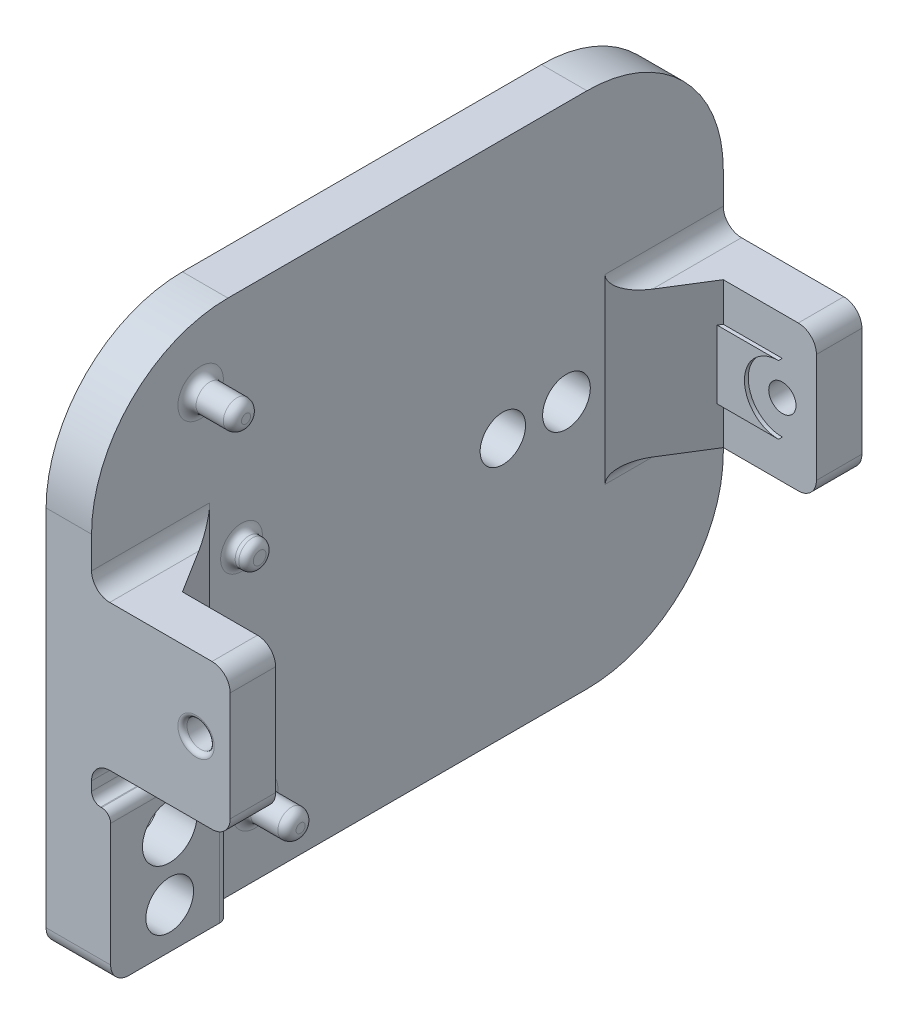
ISO-10303-21;
HEADER;
FILE_DESCRIPTION(('STEP AP214'),'2;1');
FILE_NAME('part.step','',(''),(''),'','','');
FILE_SCHEMA(('AUTOMOTIVE_DESIGN { 1 0 10303 214 1 1 1 1 }'));
ENDSEC;
DATA;
#1=APPLICATION_CONTEXT('core data for automotive mechanical design processes');
#2=APPLICATION_PROTOCOL_DEFINITION('international standard','automotive_design',2000,#1);
#3=PRODUCT_CONTEXT('',#1,'mechanical');
#4=PRODUCT('Part','Part','',(#3));
#5=PRODUCT_RELATED_PRODUCT_CATEGORY('part','',(#4));
#6=PRODUCT_DEFINITION_FORMATION('','',#4);
#7=PRODUCT_DEFINITION_CONTEXT('part definition',#1,'design');
#8=PRODUCT_DEFINITION('design','',#6,#7);
#9=PRODUCT_DEFINITION_SHAPE('','',#8);
#10=(LENGTH_UNIT() NAMED_UNIT(*) SI_UNIT(.MILLI.,.METRE.));
#11=(NAMED_UNIT(*) PLANE_ANGLE_UNIT() SI_UNIT($,.RADIAN.));
#12=(NAMED_UNIT(*) SI_UNIT($,.STERADIAN.) SOLID_ANGLE_UNIT());
#13=UNCERTAINTY_MEASURE_WITH_UNIT(LENGTH_MEASURE(1.E-05),#10,'distance_accuracy_value','');
#14=(GEOMETRIC_REPRESENTATION_CONTEXT(3) GLOBAL_UNCERTAINTY_ASSIGNED_CONTEXT((#13)) GLOBAL_UNIT_ASSIGNED_CONTEXT((#10,
#11,#12)) REPRESENTATION_CONTEXT('',''));
#15=CARTESIAN_POINT('',(0.,0.,0.));
#16=DIRECTION('',(0.,0.,1.));
#17=DIRECTION('',(1.,0.,0.));
#18=AXIS2_PLACEMENT_3D('',#15,#16,#17);
#19=CARTESIAN_POINT('',(20.25,20.5,64.5));
#20=DIRECTION('',(0.,0.,1.));
#21=DIRECTION('',(1.,0.,0.));
#22=AXIS2_PLACEMENT_3D('',#19,#20,#21);
#23=PLANE('',#22);
#24=CARTESIAN_POINT('',(16.5,28.5,64.5));
#25=DIRECTION('',(0.,0.,-1.));
#26=DIRECTION('',(-1.,0.,0.));
#27=AXIS2_PLACEMENT_3D('',#24,#25,#26);
#28=CIRCLE('',#27,1.5);
#29=CARTESIAN_POINT('',(15.,28.5,64.5));
#30=VERTEX_POINT('',#29);
#31=EDGE_CURVE('E559',#30,#30,#28,.T.);
#32=ORIENTED_EDGE('',*,*,#31,.F.);
#33=EDGE_LOOP('',(#32));
#34=FACE_BOUND('',#33,.T.);
#35=DIRECTION('',(-1.,0.,0.));
#36=VECTOR('',#35,1.);
#37=CARTESIAN_POINT('',(9.49999999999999,24.75,64.5));
#38=LINE('',#37,#36);
#39=CARTESIAN_POINT('',(16.5,24.75,64.5));
#40=VERTEX_POINT('',#39);
#41=CARTESIAN_POINT('',(9.99999999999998,24.75,64.5));
#42=VERTEX_POINT('',#41);
#43=EDGE_CURVE('E442',#40,#42,#38,.T.);
#44=ORIENTED_EDGE('',*,*,#43,.F.);
#45=CARTESIAN_POINT('',(16.5,28.5,64.5));
#46=DIRECTION('',(0.,0.,1.));
#47=DIRECTION('',(-1.,0.,0.));
#48=AXIS2_PLACEMENT_3D('',#45,#46,#47);
#49=CIRCLE('',#48,3.75);
#50=CARTESIAN_POINT('',(16.5,32.25,64.5));
#51=VERTEX_POINT('',#50);
#52=EDGE_CURVE('E418',#51,#40,#49,.T.);
#53=ORIENTED_EDGE('',*,*,#52,.F.);
#54=DIRECTION('',(1.,0.,0.));
#55=VECTOR('',#54,1.);
#56=CARTESIAN_POINT('',(9.49999999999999,32.25,64.5));
#57=LINE('',#56,#55);
#58=CARTESIAN_POINT('',(9.99999999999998,32.25,64.5));
#59=VERTEX_POINT('',#58);
#60=EDGE_CURVE('E435',#59,#51,#57,.T.);
#61=ORIENTED_EDGE('',*,*,#60,.F.);
#62=DIRECTION('',(0.,1.,0.));
#63=VECTOR('',#62,1.);
#64=CARTESIAN_POINT('',(9.99999999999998,36.5,64.5));
#65=LINE('',#64,#63);
#66=CARTESIAN_POINT('',(9.99999999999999,36.5,64.5));
#67=VERTEX_POINT('',#66);
#68=EDGE_CURVE('E680',#59,#67,#65,.T.);
#69=ORIENTED_EDGE('',*,*,#68,.T.);
#70=DIRECTION('',(-1.,0.,0.));
#71=VECTOR('',#70,1.);
#72=CARTESIAN_POINT('',(20.25,36.5,64.5));
#73=LINE('',#72,#71);
#74=CARTESIAN_POINT('',(18.25,36.5,64.5));
#75=VERTEX_POINT('',#74);
#76=EDGE_CURVE('E574',#75,#67,#73,.T.);
#77=ORIENTED_EDGE('',*,*,#76,.F.);
#78=CARTESIAN_POINT('',(18.25,34.5,64.5));
#79=DIRECTION('',(0.,0.,1.));
#80=DIRECTION('',(1.,0.,0.));
#81=AXIS2_PLACEMENT_3D('',#78,#79,#80);
#82=CIRCLE('',#81,2.);
#83=CARTESIAN_POINT('',(20.25,34.5,64.5));
#84=VERTEX_POINT('',#83);
#85=EDGE_CURVE('E763',#75,#84,#82,.F.);
#86=ORIENTED_EDGE('',*,*,#85,.T.);
#87=DIRECTION('',(0.,1.,0.));
#88=VECTOR('',#87,1.);
#89=CARTESIAN_POINT('',(20.25,20.5,64.5));
#90=LINE('',#89,#88);
#91=CARTESIAN_POINT('',(20.25,22.5,64.5));
#92=VERTEX_POINT('',#91);
#93=EDGE_CURVE('E562',#92,#84,#90,.T.);
#94=ORIENTED_EDGE('',*,*,#93,.F.);
#95=CARTESIAN_POINT('',(18.25,22.5,64.5));
#96=DIRECTION('',(0.,0.,1.));
#97=DIRECTION('',(1.,0.,0.));
#98=AXIS2_PLACEMENT_3D('',#95,#96,#97);
#99=CIRCLE('',#98,2.);
#100=CARTESIAN_POINT('',(18.25,20.5,64.5));
#101=VERTEX_POINT('',#100);
#102=EDGE_CURVE('E761',#92,#101,#99,.F.);
#103=ORIENTED_EDGE('',*,*,#102,.T.);
#104=DIRECTION('',(-1.,0.,0.));
#105=VECTOR('',#104,1.);
#106=CARTESIAN_POINT('',(20.25,20.5,64.5));
#107=LINE('',#106,#105);
#108=CARTESIAN_POINT('',(9.99999999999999,20.5,64.5));
#109=VERTEX_POINT('',#108);
#110=EDGE_CURVE('E577',#101,#109,#107,.T.);
#111=ORIENTED_EDGE('',*,*,#110,.T.);
#112=EDGE_CURVE('E681',#109,#42,#65,.T.);
#113=ORIENTED_EDGE('',*,*,#112,.T.);
#114=EDGE_LOOP('',(#44,#53,#61,#69,#77,#86,#94,#103,#111,#113));
#115=FACE_BOUND('',#114,.T.);
#116=ADVANCED_FACE('F43',(#34,#115),#23,.F.);
#117=CARTESIAN_POINT('',(9.99999999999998,20.5,64.5));
#118=DIRECTION('',(0.847998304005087,0.,-0.529998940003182));
#119=DIRECTION('',(0.,-1.,0.));
#120=AXIS2_PLACEMENT_3D('',#117,#118,#119);
#121=PLANE('',#120);
#122=DIRECTION('',(0.529998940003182,0.,0.847998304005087));
#123=VECTOR('',#122,1.);
#124=CARTESIAN_POINT('',(9.99999999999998,24.75,64.5));
#125=LINE('',#124,#123);
#126=CARTESIAN_POINT('',(9.73749999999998,24.75,64.08));
#127=VERTEX_POINT('',#126);
#128=EDGE_CURVE('E887',#42,#127,#125,.F.);
#129=ORIENTED_EDGE('',*,*,#128,.F.);
#130=ORIENTED_EDGE('',*,*,#112,.F.);
#131=DIRECTION('',(-0.529998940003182,0.,-0.847998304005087));
#132=VECTOR('',#131,1.);
#133=CARTESIAN_POINT('',(15.126404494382,20.5,72.7022471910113));
#134=LINE('',#133,#132);
#135=CARTESIAN_POINT('',(7.,20.5,59.7000000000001));
#136=VERTEX_POINT('',#135);
#137=EDGE_CURVE('E689',#136,#109,#134,.F.);
#138=ORIENTED_EDGE('',*,*,#137,.F.);
#139=CARTESIAN_POINT('',(7.,18.5,59.7000000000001));
#140=DIRECTION('',(0.847998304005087,0.,-0.529998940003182));
#141=DIRECTION('',(0.529998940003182,0.,0.847998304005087));
#142=AXIS2_PLACEMENT_3D('',#139,#140,#141);
#143=ELLIPSE('',#142,3.77359245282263,2.);
#144=CARTESIAN_POINT('',(5.,18.5,56.5000000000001));
#145=VERTEX_POINT('',#144);
#146=EDGE_CURVE('E790',#136,#145,#143,.F.);
#147=ORIENTED_EDGE('',*,*,#146,.T.);
#148=DIRECTION('',(0.,-1.,0.));
#149=VECTOR('',#148,1.);
#150=CARTESIAN_POINT('',(5.,20.5,56.5000000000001));
#151=LINE('',#150,#149);
#152=CARTESIAN_POINT('',(5.,38.5,56.5000000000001));
#153=VERTEX_POINT('',#152);
#154=EDGE_CURVE('E684',#153,#145,#151,.T.);
#155=ORIENTED_EDGE('',*,*,#154,.F.);
#156=CARTESIAN_POINT('',(7.,38.5,59.7000000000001));
#157=DIRECTION('',(0.847998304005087,0.,-0.529998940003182));
#158=DIRECTION('',(-0.529998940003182,0.,-0.847998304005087));
#159=AXIS2_PLACEMENT_3D('',#156,#157,#158);
#160=ELLIPSE('',#159,3.77359245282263,2.);
#161=CARTESIAN_POINT('',(7.,36.5,59.7000000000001));
#162=VERTEX_POINT('',#161);
#163=EDGE_CURVE('E797',#153,#162,#160,.F.);
#164=ORIENTED_EDGE('',*,*,#163,.T.);
#165=DIRECTION('',(0.529998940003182,0.,0.847998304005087));
#166=VECTOR('',#165,1.);
#167=CARTESIAN_POINT('',(15.126404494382,36.5,72.7022471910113));
#168=LINE('',#167,#166);
#169=EDGE_CURVE('E686',#67,#162,#168,.F.);
#170=ORIENTED_EDGE('',*,*,#169,.F.);
#171=ORIENTED_EDGE('',*,*,#68,.F.);
#172=DIRECTION('',(-0.529998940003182,0.,-0.847998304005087));
#173=VECTOR('',#172,1.);
#174=CARTESIAN_POINT('',(9.99999999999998,32.25,64.5));
#175=LINE('',#174,#173);
#176=CARTESIAN_POINT('',(9.73749999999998,32.25,64.08));
#177=VERTEX_POINT('',#176);
#178=EDGE_CURVE('E885',#177,#59,#175,.F.);
#179=ORIENTED_EDGE('',*,*,#178,.F.);
#180=DIRECTION('',(0.,1.,0.));
#181=VECTOR('',#180,1.);
#182=CARTESIAN_POINT('',(9.73749999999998,20.5,64.08));
#183=LINE('',#182,#181);
#184=EDGE_CURVE('E882',#177,#127,#183,.F.);
#185=ORIENTED_EDGE('',*,*,#184,.T.);
#186=EDGE_LOOP('',(#129,#130,#138,#147,#155,#164,#170,#171,#179,#185));
#187=FACE_BOUND('',#186,.T.);
#188=ADVANCED_FACE('F952',(#187),#121,.T.);
#189=CARTESIAN_POINT('',(5.,0.,0.));
#190=DIRECTION('',(-1.,0.,0.));
#191=DIRECTION('',(0.,0.,1.));
#192=AXIS2_PLACEMENT_3D('',#189,#190,#191);
#193=PLANE('',#192);
#194=CARTESIAN_POINT('',(5.,32.5,53.));
#195=DIRECTION('',(-1.,0.,0.));
#196=DIRECTION('',(0.,0.,1.));
#197=AXIS2_PLACEMENT_3D('',#194,#195,#196);
#198=CIRCLE('',#197,2.3);
#199=CARTESIAN_POINT('',(5.,32.5,55.3));
#200=VERTEX_POINT('',#199);
#201=EDGE_CURVE('E879',#200,#200,#198,.T.);
#202=ORIENTED_EDGE('',*,*,#201,.T.);
#203=EDGE_LOOP('',(#202));
#204=FACE_BOUND('',#203,.T.);
#205=CARTESIAN_POINT('',(5.,7.5,51.5));
#206=DIRECTION('',(-1.,0.,0.));
#207=DIRECTION('',(0.,0.,1.));
#208=AXIS2_PLACEMENT_3D('',#205,#206,#207);
#209=CIRCLE('',#208,2.5);
#210=CARTESIAN_POINT('',(5.,7.5,54.));
#211=VERTEX_POINT('',#210);
#212=EDGE_CURVE('E818',#211,#211,#209,.T.);
#213=ORIENTED_EDGE('',*,*,#212,.T.);
#214=EDGE_LOOP('',(#213));
#215=FACE_BOUND('',#214,.T.);
#216=CARTESIAN_POINT('',(5.,49.5,57.5));
#217=DIRECTION('',(-1.,0.,0.));
#218=DIRECTION('',(0.,0.,1.));
#219=AXIS2_PLACEMENT_3D('',#216,#217,#218);
#220=CIRCLE('',#219,2.5);
#221=CARTESIAN_POINT('',(5.,49.5,60.));
#222=VERTEX_POINT('',#221);
#223=EDGE_CURVE('E815',#222,#222,#220,.T.);
#224=ORIENTED_EDGE('',*,*,#223,.T.);
#225=EDGE_LOOP('',(#224));
#226=FACE_BOUND('',#225,.T.);
#227=CARTESIAN_POINT('',(5.,28.5,24.25));
#228=DIRECTION('',(1.,0.,0.));
#229=DIRECTION('',(0.,0.,-1.));
#230=AXIS2_PLACEMENT_3D('',#227,#228,#229);
#231=CIRCLE('',#230,2.5);
#232=CARTESIAN_POINT('',(5.,28.5,21.75));
#233=VERTEX_POINT('',#232);
#234=EDGE_CURVE('E590',#233,#233,#231,.T.);
#235=ORIENTED_EDGE('',*,*,#234,.F.);
#236=EDGE_LOOP('',(#235));
#237=FACE_BOUND('',#236,.T.);
#238=CARTESIAN_POINT('',(5.,28.5,17.25));
#239=DIRECTION('',(1.,0.,0.));
#240=DIRECTION('',(0.,0.,-1.));
#241=AXIS2_PLACEMENT_3D('',#238,#239,#240);
#242=CIRCLE('',#241,2.625);
#243=CARTESIAN_POINT('',(5.,28.5,14.625));
#244=VERTEX_POINT('',#243);
#245=EDGE_CURVE('E581',#244,#244,#242,.T.);
#246=ORIENTED_EDGE('',*,*,#245,.F.);
#247=EDGE_LOOP('',(#246));
#248=FACE_BOUND('',#247,.T.);
#249=DIRECTION('',(0.,-1.,0.));
#250=VECTOR('',#249,1.);
#251=CARTESIAN_POINT('',(5.,0.,69.5));
#252=LINE('',#251,#250);
#253=CARTESIAN_POINT('',(5.,18.5,69.5));
#254=VERTEX_POINT('',#253);
#255=CARTESIAN_POINT('',(5.,17.5,69.5));
#256=VERTEX_POINT('',#255);
#257=EDGE_CURVE('E611',#254,#256,#252,.T.);
#258=ORIENTED_EDGE('',*,*,#257,.T.);
#259=DIRECTION('',(0.,0.,1.));
#260=VECTOR('',#259,1.);
#261=CARTESIAN_POINT('',(5.,17.5,56.5));
#262=LINE('',#261,#260);
#263=CARTESIAN_POINT('',(5.,17.5,57.5));
#264=VERTEX_POINT('',#263);
#265=EDGE_CURVE('E813',#256,#264,#262,.F.);
#266=ORIENTED_EDGE('',*,*,#265,.T.);
#267=CARTESIAN_POINT('',(5.,15.5,57.5));
#268=DIRECTION('',(-1.,0.,0.));
#269=DIRECTION('',(0.,0.,1.));
#270=AXIS2_PLACEMENT_3D('',#267,#268,#269);
#271=CIRCLE('',#270,2.);
#272=CARTESIAN_POINT('',(5.,15.5,55.5));
#273=VERTEX_POINT('',#272);
#274=EDGE_CURVE('E810',#273,#264,#271,.F.);
#275=ORIENTED_EDGE('',*,*,#274,.F.);
#276=DIRECTION('',(0.,1.,0.));
#277=VECTOR('',#276,1.);
#278=CARTESIAN_POINT('',(5.,0.,55.5));
#279=LINE('',#278,#277);
#280=CARTESIAN_POINT('',(5.,0.,55.5));
#281=VERTEX_POINT('',#280);
#282=EDGE_CURVE('E808',#273,#281,#279,.F.);
#283=ORIENTED_EDGE('',*,*,#282,.T.);
#284=DIRECTION('',(0.,0.,-1.));
#285=VECTOR('',#284,1.);
#286=CARTESIAN_POINT('',(5.,0.,0.));
#287=LINE('',#286,#285);
#288=CARTESIAN_POINT('',(5.,0.,15.));
#289=VERTEX_POINT('',#288);
#290=EDGE_CURVE('E601',#281,#289,#287,.T.);
#291=ORIENTED_EDGE('',*,*,#290,.T.);
#292=CARTESIAN_POINT('',(5.,15.,15.));
#293=DIRECTION('',(-1.,0.,0.));
#294=DIRECTION('',(0.,0.,1.));
#295=AXIS2_PLACEMENT_3D('',#292,#293,#294);
#296=CIRCLE('',#295,15.);
#297=CARTESIAN_POINT('',(5.,15.,0.));
#298=VERTEX_POINT('',#297);
#299=EDGE_CURVE('E670',#289,#298,#296,.F.);
#300=ORIENTED_EDGE('',*,*,#299,.T.);
#301=DIRECTION('',(0.,1.,0.));
#302=VECTOR('',#301,1.);
#303=CARTESIAN_POINT('',(5.,0.,0.));
#304=LINE('',#303,#302);
#305=CARTESIAN_POINT('',(5.,18.5,0.));
#306=VERTEX_POINT('',#305);
#307=EDGE_CURVE('E605',#298,#306,#304,.T.);
#308=ORIENTED_EDGE('',*,*,#307,.T.);
#309=DIRECTION('',(0.,0.,1.));
#310=VECTOR('',#309,1.);
#311=CARTESIAN_POINT('',(5.,18.5,0.));
#312=LINE('',#311,#310);
#313=CARTESIAN_POINT('',(5.,18.5,13.));
#314=VERTEX_POINT('',#313);
#315=EDGE_CURVE('E775',#306,#314,#312,.T.);
#316=ORIENTED_EDGE('',*,*,#315,.T.);
#317=DIRECTION('',(0.,1.,0.));
#318=VECTOR('',#317,1.);
#319=CARTESIAN_POINT('',(5.,0.,13.));
#320=LINE('',#319,#318);
#321=CARTESIAN_POINT('',(5.,38.5,13.));
#322=VERTEX_POINT('',#321);
#323=EDGE_CURVE('E691',#314,#322,#320,.T.);
#324=ORIENTED_EDGE('',*,*,#323,.T.);
#325=DIRECTION('',(0.,0.,-1.));
#326=VECTOR('',#325,1.);
#327=CARTESIAN_POINT('',(5.,38.5,0.));
#328=LINE('',#327,#326);
#329=CARTESIAN_POINT('',(5.,38.5,0.));
#330=VERTEX_POINT('',#329);
#331=EDGE_CURVE('E778',#322,#330,#328,.T.);
#332=ORIENTED_EDGE('',*,*,#331,.T.);
#333=CARTESIAN_POINT('',(5.,42.,0.));
#334=VERTEX_POINT('',#333);
#335=EDGE_CURVE('E603',#330,#334,#304,.T.);
#336=ORIENTED_EDGE('',*,*,#335,.T.);
#337=CARTESIAN_POINT('',(5.,42.,15.));
#338=DIRECTION('',(-1.,0.,0.));
#339=DIRECTION('',(0.,0.,1.));
#340=AXIS2_PLACEMENT_3D('',#337,#338,#339);
#341=CIRCLE('',#340,15.);
#342=CARTESIAN_POINT('',(5.,57.,15.));
#343=VERTEX_POINT('',#342);
#344=EDGE_CURVE('E672',#334,#343,#341,.F.);
#345=ORIENTED_EDGE('',*,*,#344,.T.);
#346=DIRECTION('',(0.,0.,1.));
#347=VECTOR('',#346,1.);
#348=CARTESIAN_POINT('',(5.,57.,0.));
#349=LINE('',#348,#347);
#350=CARTESIAN_POINT('',(5.,57.,54.5));
#351=VERTEX_POINT('',#350);
#352=EDGE_CURVE('E608',#343,#351,#349,.T.);
#353=ORIENTED_EDGE('',*,*,#352,.T.);
#354=CARTESIAN_POINT('',(5.,42.,54.5));
#355=DIRECTION('',(-1.,0.,0.));
#356=DIRECTION('',(0.,0.,1.));
#357=AXIS2_PLACEMENT_3D('',#354,#355,#356);
#358=CIRCLE('',#357,15.);
#359=CARTESIAN_POINT('',(5.,42.,69.5));
#360=VERTEX_POINT('',#359);
#361=EDGE_CURVE('E668',#351,#360,#358,.F.);
#362=ORIENTED_EDGE('',*,*,#361,.T.);
#363=CARTESIAN_POINT('',(5.,38.5,69.5));
#364=VERTEX_POINT('',#363);
#365=EDGE_CURVE('E612',#360,#364,#252,.T.);
#366=ORIENTED_EDGE('',*,*,#365,.T.);
#367=DIRECTION('',(0.,0.,1.));
#368=VECTOR('',#367,1.);
#369=CARTESIAN_POINT('',(5.,38.5,56.5000000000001));
#370=LINE('',#369,#368);
#371=EDGE_CURVE('E770',#364,#153,#370,.F.);
#372=ORIENTED_EDGE('',*,*,#371,.T.);
#373=ORIENTED_EDGE('',*,*,#154,.T.);
#374=DIRECTION('',(0.,0.,-1.));
#375=VECTOR('',#374,1.);
#376=CARTESIAN_POINT('',(5.,18.5,69.5));
#377=LINE('',#376,#375);
#378=EDGE_CURVE('E773',#145,#254,#377,.F.);
#379=ORIENTED_EDGE('',*,*,#378,.T.);
#380=EDGE_LOOP('',(#258,#266,#275,#283,#291,#300,#308,#316,#324,#332,#336,#345,#353,#362,#366,
#372,#373,#379));
#381=FACE_BOUND('',#380,.T.);
#382=ADVANCED_FACE('F914',(#204,#215,#226,#237,#248,#381),#193,.F.);
#383=CARTESIAN_POINT('',(0.,0.,0.));
#384=DIRECTION('',(-1.,0.,0.));
#385=DIRECTION('',(0.,0.,1.));
#386=AXIS2_PLACEMENT_3D('',#383,#384,#385);
#387=PLANE('',#386);
#388=DIRECTION('',(0.,-0.707106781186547,-0.707106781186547));
#389=VECTOR('',#388,1.);
#390=CARTESIAN_POINT('',(0.,8.24730880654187,58.898780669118));
#391=LINE('',#390,#389);
#392=CARTESIAN_POINT('',(0.,15.601219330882,66.2526911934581));
#393=VERTEX_POINT('',#392);
#394=CARTESIAN_POINT('',(0.,14.0027250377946,64.6541969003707));
#395=VERTEX_POINT('',#394);
#396=EDGE_CURVE('E483',#393,#395,#391,.T.);
#397=ORIENTED_EDGE('',*,*,#396,.F.);
#398=DIRECTION('',(0.,0.707106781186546,-0.707106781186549));
#399=VECTOR('',#398,1.);
#400=CARTESIAN_POINT('',(0.,15.601219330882,66.2526911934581));
#401=LINE('',#400,#399);
#402=CARTESIAN_POINT('',(0.,14.7526911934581,67.101219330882));
#403=VERTEX_POINT('',#402);
#404=EDGE_CURVE('E492',#403,#393,#401,.T.);
#405=ORIENTED_EDGE('',*,*,#404,.F.);
#406=DIRECTION('',(0.,0.707106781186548,0.707106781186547));
#407=VECTOR('',#406,1.);
#408=CARTESIAN_POINT('',(0.,14.7526911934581,67.101219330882));
#409=LINE('',#408,#407);
#410=CARTESIAN_POINT('',(0.,13.1541969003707,65.5027250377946));
#411=VERTEX_POINT('',#410);
#412=EDGE_CURVE('E489',#411,#403,#409,.T.);
#413=ORIENTED_EDGE('',*,*,#412,.F.);
#414=CARTESIAN_POINT('',(0.,11.5,63.));
#415=DIRECTION('',(1.,0.,0.));
#416=DIRECTION('',(0.,0.,-1.));
#417=AXIS2_PLACEMENT_3D('',#414,#415,#416);
#418=CIRCLE('',#417,3.);
#419=CARTESIAN_POINT('',(0.,8.99727496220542,61.3458030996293));
#420=VERTEX_POINT('',#419);
#421=EDGE_CURVE('E589',#411,#420,#418,.T.);
#422=ORIENTED_EDGE('',*,*,#421,.T.);
#423=CARTESIAN_POINT('',(0.,7.39878066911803,59.7473088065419));
#424=VERTEX_POINT('',#423);
#425=EDGE_CURVE('E490',#424,#420,#409,.T.);
#426=ORIENTED_EDGE('',*,*,#425,.F.);
#427=DIRECTION('',(0.,-0.707106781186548,0.707106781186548));
#428=VECTOR('',#427,1.);
#429=CARTESIAN_POINT('',(0.,7.39878066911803,59.7473088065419));
#430=LINE('',#429,#428);
#431=CARTESIAN_POINT('',(0.,8.24730880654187,58.898780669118));
#432=VERTEX_POINT('',#431);
#433=EDGE_CURVE('E485',#432,#424,#430,.T.);
#434=ORIENTED_EDGE('',*,*,#433,.F.);
#435=CARTESIAN_POINT('',(0.,9.84580309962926,60.4972749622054));
#436=VERTEX_POINT('',#435);
#437=EDGE_CURVE('E486',#436,#432,#391,.T.);
#438=ORIENTED_EDGE('',*,*,#437,.F.);
#439=EDGE_CURVE('E584',#436,#395,#418,.T.);
#440=ORIENTED_EDGE('',*,*,#439,.T.);
#441=EDGE_LOOP('',(#397,#405,#413,#422,#426,#434,#438,#440));
#442=FACE_BOUND('',#441,.T.);
#443=DIRECTION('',(0.,1.,0.));
#444=VECTOR('',#443,1.);
#445=CARTESIAN_POINT('',(0.,23.3,24.85));
#446=LINE('',#445,#444);
#447=CARTESIAN_POINT('',(0.,30.9269322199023,24.85));
#448=VERTEX_POINT('',#447);
#449=CARTESIAN_POINT('',(0.,33.7,24.85));
#450=VERTEX_POINT('',#449);
#451=EDGE_CURVE('E519',#448,#450,#446,.T.);
#452=ORIENTED_EDGE('',*,*,#451,.F.);
#453=CARTESIAN_POINT('',(0.,28.5,24.25));
#454=DIRECTION('',(1.,0.,0.));
#455=DIRECTION('',(0.,0.,-1.));
#456=AXIS2_PLACEMENT_3D('',#453,#454,#455);
#457=CIRCLE('',#456,2.5);
#458=CARTESIAN_POINT('',(0.,26.0730677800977,24.85));
#459=VERTEX_POINT('',#458);
#460=EDGE_CURVE('E594',#448,#459,#457,.T.);
#461=ORIENTED_EDGE('',*,*,#460,.T.);
#462=CARTESIAN_POINT('',(0.,23.3,24.85));
#463=VERTEX_POINT('',#462);
#464=EDGE_CURVE('E516',#463,#459,#446,.T.);
#465=ORIENTED_EDGE('',*,*,#464,.F.);
#466=DIRECTION('',(0.,0.,1.));
#467=VECTOR('',#466,1.);
#468=CARTESIAN_POINT('',(0.,23.3,23.65));
#469=LINE('',#468,#467);
#470=CARTESIAN_POINT('',(0.,23.3,23.65));
#471=VERTEX_POINT('',#470);
#472=EDGE_CURVE('E518',#471,#463,#469,.T.);
#473=ORIENTED_EDGE('',*,*,#472,.F.);
#474=DIRECTION('',(0.,-1.,0.));
#475=VECTOR('',#474,1.);
#476=CARTESIAN_POINT('',(0.,33.7,23.65));
#477=LINE('',#476,#475);
#478=CARTESIAN_POINT('',(0.,26.0730677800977,23.65));
#479=VERTEX_POINT('',#478);
#480=EDGE_CURVE('E522',#479,#471,#477,.T.);
#481=ORIENTED_EDGE('',*,*,#480,.F.);
#482=CARTESIAN_POINT('',(0.,30.9269322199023,23.65));
#483=VERTEX_POINT('',#482);
#484=EDGE_CURVE('E595',#479,#483,#457,.T.);
#485=ORIENTED_EDGE('',*,*,#484,.T.);
#486=CARTESIAN_POINT('',(0.,33.7,23.65));
#487=VERTEX_POINT('',#486);
#488=EDGE_CURVE('E523',#487,#483,#477,.T.);
#489=ORIENTED_EDGE('',*,*,#488,.F.);
#490=DIRECTION('',(0.,0.,-1.));
#491=VECTOR('',#490,1.);
#492=CARTESIAN_POINT('',(0.,33.7,24.85));
#493=LINE('',#492,#491);
#494=EDGE_CURVE('E525',#450,#487,#493,.T.);
#495=ORIENTED_EDGE('',*,*,#494,.F.);
#496=EDGE_LOOP('',(#452,#461,#465,#473,#481,#485,#489,#495));
#497=FACE_BOUND('',#496,.T.);
#498=CARTESIAN_POINT('',(0.,4.5,63.));
#499=DIRECTION('',(1.,0.,0.));
#500=DIRECTION('',(0.,0.,-1.));
#501=AXIS2_PLACEMENT_3D('',#498,#499,#500);
#502=CIRCLE('',#501,2.625);
#503=CARTESIAN_POINT('',(0.,4.5,60.375));
#504=VERTEX_POINT('',#503);
#505=EDGE_CURVE('E593',#504,#504,#502,.T.);
#506=ORIENTED_EDGE('',*,*,#505,.T.);
#507=EDGE_LOOP('',(#506));
#508=FACE_BOUND('',#507,.T.);
#509=DIRECTION('',(0.,0.,-1.));
#510=VECTOR('',#509,1.);
#511=CARTESIAN_POINT('',(0.,0.,0.));
#512=LINE('',#511,#510);
#513=CARTESIAN_POINT('',(0.,0.,67.5));
#514=VERTEX_POINT('',#513);
#515=CARTESIAN_POINT('',(0.,0.,15.));
#516=VERTEX_POINT('',#515);
#517=EDGE_CURVE('E600',#514,#516,#512,.T.);
#518=ORIENTED_EDGE('',*,*,#517,.F.);
#519=CARTESIAN_POINT('',(0.,2.,67.5));
#520=DIRECTION('',(-1.,0.,0.));
#521=DIRECTION('',(0.,0.,1.));
#522=AXIS2_PLACEMENT_3D('',#519,#520,#521);
#523=CIRCLE('',#522,2.);
#524=CARTESIAN_POINT('',(0.,2.,69.5));
#525=VERTEX_POINT('',#524);
#526=EDGE_CURVE('E717',#514,#525,#523,.T.);
#527=ORIENTED_EDGE('',*,*,#526,.T.);
#528=DIRECTION('',(0.,-1.,0.));
#529=VECTOR('',#528,1.);
#530=CARTESIAN_POINT('',(0.,0.,69.5));
#531=LINE('',#530,#529);
#532=CARTESIAN_POINT('',(0.,42.,69.5));
#533=VERTEX_POINT('',#532);
#534=EDGE_CURVE('E604',#533,#525,#531,.T.);
#535=ORIENTED_EDGE('',*,*,#534,.F.);
#536=CARTESIAN_POINT('',(0.,42.,54.5));
#537=DIRECTION('',(-1.,0.,0.));
#538=DIRECTION('',(0.,0.,1.));
#539=AXIS2_PLACEMENT_3D('',#536,#537,#538);
#540=CIRCLE('',#539,15.);
#541=CARTESIAN_POINT('',(0.,57.,54.5));
#542=VERTEX_POINT('',#541);
#543=EDGE_CURVE('E655',#533,#542,#540,.T.);
#544=ORIENTED_EDGE('',*,*,#543,.T.);
#545=DIRECTION('',(0.,0.,1.));
#546=VECTOR('',#545,1.);
#547=CARTESIAN_POINT('',(0.,57.,0.));
#548=LINE('',#547,#546);
#549=CARTESIAN_POINT('',(0.,57.,15.));
#550=VERTEX_POINT('',#549);
#551=EDGE_CURVE('E620',#550,#542,#548,.T.);
#552=ORIENTED_EDGE('',*,*,#551,.F.);
#553=CARTESIAN_POINT('',(0.,42.,15.));
#554=DIRECTION('',(-1.,0.,0.));
#555=DIRECTION('',(0.,0.,1.));
#556=AXIS2_PLACEMENT_3D('',#553,#554,#555);
#557=CIRCLE('',#556,15.);
#558=CARTESIAN_POINT('',(0.,42.,0.));
#559=VERTEX_POINT('',#558);
#560=EDGE_CURVE('E660',#550,#559,#557,.T.);
#561=ORIENTED_EDGE('',*,*,#560,.T.);
#562=DIRECTION('',(0.,1.,0.));
#563=VECTOR('',#562,1.);
#564=CARTESIAN_POINT('',(0.,0.,0.));
#565=LINE('',#564,#563);
#566=CARTESIAN_POINT('',(0.,15.,0.));
#567=VERTEX_POINT('',#566);
#568=EDGE_CURVE('E617',#567,#559,#565,.T.);
#569=ORIENTED_EDGE('',*,*,#568,.F.);
#570=CARTESIAN_POINT('',(0.,15.,15.));
#571=DIRECTION('',(-1.,0.,0.));
#572=DIRECTION('',(0.,0.,1.));
#573=AXIS2_PLACEMENT_3D('',#570,#571,#572);
#574=CIRCLE('',#573,15.);
#575=EDGE_CURVE('E657',#567,#516,#574,.T.);
#576=ORIENTED_EDGE('',*,*,#575,.T.);
#577=EDGE_LOOP('',(#518,#527,#535,#544,#552,#561,#569,#576));
#578=FACE_BOUND('',#577,.T.);
#579=CARTESIAN_POINT('',(0.,28.5,17.25));
#580=DIRECTION('',(1.,0.,0.));
#581=DIRECTION('',(0.,0.,-1.));
#582=AXIS2_PLACEMENT_3D('',#579,#580,#581);
#583=CIRCLE('',#582,2.625);
#584=CARTESIAN_POINT('',(0.,28.5,14.625));
#585=VERTEX_POINT('',#584);
#586=EDGE_CURVE('E580',#585,#585,#583,.T.);
#587=ORIENTED_EDGE('',*,*,#586,.T.);
#588=EDGE_LOOP('',(#587));
#589=FACE_BOUND('',#588,.T.);
#590=ADVANCED_FACE('F1036',(#442,#497,#508,#578,#589),#387,.T.);
#591=CARTESIAN_POINT('',(5.,0.,0.));
#592=DIRECTION('',(0.,1.,0.));
#593=DIRECTION('',(0.,0.,1.));
#594=AXIS2_PLACEMENT_3D('',#591,#592,#593);
#595=PLANE('',#594);
#596=DIRECTION('',(-1.,0.,0.));
#597=VECTOR('',#596,1.);
#598=CARTESIAN_POINT('',(7.1,0.,56.5));
#599=LINE('',#598,#597);
#600=CARTESIAN_POINT('',(6.1,0.,56.5));
#601=VERTEX_POINT('',#600);
#602=CARTESIAN_POINT('',(6.,0.,56.5));
#603=VERTEX_POINT('',#602);
#604=EDGE_CURVE('E479',#601,#603,#599,.T.);
#605=ORIENTED_EDGE('',*,*,#604,.F.);
#606=CARTESIAN_POINT('',(6.1,0.,57.5));
#607=DIRECTION('',(0.,1.,0.));
#608=DIRECTION('',(0.,0.,1.));
#609=AXIS2_PLACEMENT_3D('',#606,#607,#608);
#610=CIRCLE('',#609,1.);
#611=CARTESIAN_POINT('',(7.1,0.,57.5));
#612=VERTEX_POINT('',#611);
#613=EDGE_CURVE('E849',#601,#612,#610,.F.);
#614=ORIENTED_EDGE('',*,*,#613,.T.);
#615=DIRECTION('',(0.,0.,-1.));
#616=VECTOR('',#615,1.);
#617=CARTESIAN_POINT('',(7.1,0.,69.5));
#618=LINE('',#617,#616);
#619=CARTESIAN_POINT('',(7.1,0.,67.5));
#620=VERTEX_POINT('',#619);
#621=EDGE_CURVE('E471',#620,#612,#618,.T.);
#622=ORIENTED_EDGE('',*,*,#621,.F.);
#623=DIRECTION('',(-1.,0.,0.));
#624=VECTOR('',#623,1.);
#625=CARTESIAN_POINT('',(5.,0.,67.5));
#626=LINE('',#625,#624);
#627=EDGE_CURVE('E714',#620,#514,#626,.T.);
#628=ORIENTED_EDGE('',*,*,#627,.T.);
#629=ORIENTED_EDGE('',*,*,#517,.T.);
#630=DIRECTION('',(-1.,0.,0.));
#631=VECTOR('',#630,1.);
#632=CARTESIAN_POINT('',(5.,0.,15.));
#633=LINE('',#632,#631);
#634=EDGE_CURVE('E674',#516,#289,#633,.F.);
#635=ORIENTED_EDGE('',*,*,#634,.T.);
#636=ORIENTED_EDGE('',*,*,#290,.F.);
#637=CARTESIAN_POINT('',(6.,0.,55.5));
#638=DIRECTION('',(0.,1.,0.));
#639=DIRECTION('',(0.,0.,1.));
#640=AXIS2_PLACEMENT_3D('',#637,#638,#639);
#641=CIRCLE('',#640,1.);
#642=EDGE_CURVE('E853',#281,#603,#641,.T.);
#643=ORIENTED_EDGE('',*,*,#642,.T.);
#644=EDGE_LOOP('',(#605,#614,#622,#628,#629,#635,#636,#643));
#645=FACE_BOUND('',#644,.T.);
#646=ADVANCED_FACE('F1040',(#645),#595,.F.);
#647=CARTESIAN_POINT('',(5.,0.,0.));
#648=DIRECTION('',(0.,0.,1.));
#649=DIRECTION('',(1.,0.,0.));
#650=AXIS2_PLACEMENT_3D('',#647,#648,#649);
#651=PLANE('',#650);
#652=CARTESIAN_POINT('',(16.5,28.5,0.));
#653=DIRECTION('',(0.,0.,1.));
#654=DIRECTION('',(1.,0.,0.));
#655=AXIS2_PLACEMENT_3D('',#652,#653,#654);
#656=CIRCLE('',#655,2.);
#657=CARTESIAN_POINT('',(18.5,28.5,0.));
#658=VERTEX_POINT('',#657);
#659=EDGE_CURVE('E705',#658,#658,#656,.T.);
#660=ORIENTED_EDGE('',*,*,#659,.T.);
#661=EDGE_LOOP('',(#660));
#662=FACE_BOUND('',#661,.T.);
#663=DIRECTION('',(0.,-1.,0.));
#664=VECTOR('',#663,1.);
#665=CARTESIAN_POINT('',(20.25,20.5,0.));
#666=LINE('',#665,#664);
#667=CARTESIAN_POINT('',(20.25,34.5,0.));
#668=VERTEX_POINT('',#667);
#669=CARTESIAN_POINT('',(20.25,22.5,0.));
#670=VERTEX_POINT('',#669);
#671=EDGE_CURVE('E541',#668,#670,#666,.T.);
#672=ORIENTED_EDGE('',*,*,#671,.T.);
#673=CARTESIAN_POINT('',(18.25,22.5,0.));
#674=DIRECTION('',(0.,0.,1.));
#675=DIRECTION('',(1.,0.,0.));
#676=AXIS2_PLACEMENT_3D('',#673,#674,#675);
#677=CIRCLE('',#676,2.);
#678=CARTESIAN_POINT('',(18.25,20.5,0.));
#679=VERTEX_POINT('',#678);
#680=EDGE_CURVE('E743',#670,#679,#677,.F.);
#681=ORIENTED_EDGE('',*,*,#680,.T.);
#682=DIRECTION('',(-1.,0.,0.));
#683=VECTOR('',#682,1.);
#684=CARTESIAN_POINT('',(20.25,20.5,0.));
#685=LINE('',#684,#683);
#686=CARTESIAN_POINT('',(7.,20.5,0.));
#687=VERTEX_POINT('',#686);
#688=EDGE_CURVE('E556',#679,#687,#685,.T.);
#689=ORIENTED_EDGE('',*,*,#688,.T.);
#690=CARTESIAN_POINT('',(7.,18.5,0.));
#691=DIRECTION('',(0.,0.,1.));
#692=DIRECTION('',(1.,0.,0.));
#693=AXIS2_PLACEMENT_3D('',#690,#691,#692);
#694=CIRCLE('',#693,2.);
#695=EDGE_CURVE('E788',#687,#306,#694,.T.);
#696=ORIENTED_EDGE('',*,*,#695,.T.);
#697=ORIENTED_EDGE('',*,*,#307,.F.);
#698=DIRECTION('',(-1.,0.,0.));
#699=VECTOR('',#698,1.);
#700=CARTESIAN_POINT('',(5.,15.,0.));
#701=LINE('',#700,#699);
#702=EDGE_CURVE('E662',#298,#567,#701,.T.);
#703=ORIENTED_EDGE('',*,*,#702,.T.);
#704=ORIENTED_EDGE('',*,*,#568,.T.);
#705=DIRECTION('',(-1.,0.,0.));
#706=VECTOR('',#705,1.);
#707=CARTESIAN_POINT('',(5.,42.,0.));
#708=LINE('',#707,#706);
#709=EDGE_CURVE('E665',#559,#334,#708,.F.);
#710=ORIENTED_EDGE('',*,*,#709,.T.);
#711=ORIENTED_EDGE('',*,*,#335,.F.);
#712=CARTESIAN_POINT('',(7.,38.5,0.));
#713=DIRECTION('',(0.,0.,1.));
#714=DIRECTION('',(1.,0.,0.));
#715=AXIS2_PLACEMENT_3D('',#712,#713,#714);
#716=CIRCLE('',#715,2.);
#717=CARTESIAN_POINT('',(7.,36.5,0.));
#718=VERTEX_POINT('',#717);
#719=EDGE_CURVE('E781',#330,#718,#716,.T.);
#720=ORIENTED_EDGE('',*,*,#719,.T.);
#721=DIRECTION('',(-1.,0.,0.));
#722=VECTOR('',#721,1.);
#723=CARTESIAN_POINT('',(20.25,36.5,0.));
#724=LINE('',#723,#722);
#725=CARTESIAN_POINT('',(18.25,36.5,0.));
#726=VERTEX_POINT('',#725);
#727=EDGE_CURVE('E553',#726,#718,#724,.T.);
#728=ORIENTED_EDGE('',*,*,#727,.F.);
#729=CARTESIAN_POINT('',(18.25,34.5,0.));
#730=DIRECTION('',(0.,0.,1.));
#731=DIRECTION('',(1.,0.,0.));
#732=AXIS2_PLACEMENT_3D('',#729,#730,#731);
#733=CIRCLE('',#732,2.);
#734=EDGE_CURVE('E741',#726,#668,#733,.F.);
#735=ORIENTED_EDGE('',*,*,#734,.T.);
#736=EDGE_LOOP('',(#672,#681,#689,#696,#697,#703,#704,#710,#711,#720,#728,#735));
#737=FACE_BOUND('',#736,.T.);
#738=ADVANCED_FACE('F916',(#662,#737),#651,.F.);
#739=CARTESIAN_POINT('',(5.,57.,0.));
#740=DIRECTION('',(0.,-1.,0.));
#741=DIRECTION('',(0.,0.,-1.));
#742=AXIS2_PLACEMENT_3D('',#739,#740,#741);
#743=PLANE('',#742);
#744=ORIENTED_EDGE('',*,*,#352,.F.);
#745=DIRECTION('',(-1.,0.,0.));
#746=VECTOR('',#745,1.);
#747=CARTESIAN_POINT('',(5.,57.,15.));
#748=LINE('',#747,#746);
#749=EDGE_CURVE('E652',#343,#550,#748,.T.);
#750=ORIENTED_EDGE('',*,*,#749,.T.);
#751=ORIENTED_EDGE('',*,*,#551,.T.);
#752=DIRECTION('',(-1.,0.,0.));
#753=VECTOR('',#752,1.);
#754=CARTESIAN_POINT('',(5.,57.,54.5));
#755=LINE('',#754,#753);
#756=EDGE_CURVE('E650',#542,#351,#755,.F.);
#757=ORIENTED_EDGE('',*,*,#756,.T.);
#758=EDGE_LOOP('',(#744,#750,#751,#757));
#759=FACE_BOUND('',#758,.T.);
#760=ADVANCED_FACE('F927',(#759),#743,.F.);
#761=CARTESIAN_POINT('',(5.,0.,69.5));
#762=DIRECTION('',(0.,0.,-1.));
#763=DIRECTION('',(-1.,0.,0.));
#764=AXIS2_PLACEMENT_3D('',#761,#762,#763);
#765=PLANE('',#764);
#766=CARTESIAN_POINT('',(16.5,28.5,69.5));
#767=DIRECTION('',(0.,0.,-1.));
#768=DIRECTION('',(-1.,0.,0.));
#769=AXIS2_PLACEMENT_3D('',#766,#767,#768);
#770=CIRCLE('',#769,2.);
#771=CARTESIAN_POINT('',(14.5,28.5,69.5));
#772=VERTEX_POINT('',#771);
#773=EDGE_CURVE('E708',#772,#772,#770,.T.);
#774=ORIENTED_EDGE('',*,*,#773,.T.);
#775=EDGE_LOOP('',(#774));
#776=FACE_BOUND('',#775,.T.);
#777=DIRECTION('',(0.,-1.,0.));
#778=VECTOR('',#777,1.);
#779=CARTESIAN_POINT('',(7.1,0.,69.5));
#780=LINE('',#779,#778);
#781=CARTESIAN_POINT('',(7.1,15.5,69.5));
#782=VERTEX_POINT('',#781);
#783=CARTESIAN_POINT('',(7.1,2.,69.5));
#784=VERTEX_POINT('',#783);
#785=EDGE_CURVE('E474',#782,#784,#780,.T.);
#786=ORIENTED_EDGE('',*,*,#785,.F.);
#787=CARTESIAN_POINT('',(6.1,15.5,69.5));
#788=DIRECTION('',(0.,0.,-1.));
#789=DIRECTION('',(-1.,0.,0.));
#790=AXIS2_PLACEMENT_3D('',#787,#788,#789);
#791=CIRCLE('',#790,1.);
#792=CARTESIAN_POINT('',(6.1,16.5,69.5));
#793=VERTEX_POINT('',#792);
#794=EDGE_CURVE('E847',#782,#793,#791,.F.);
#795=ORIENTED_EDGE('',*,*,#794,.T.);
#796=DIRECTION('',(-1.,0.,0.));
#797=VECTOR('',#796,1.);
#798=CARTESIAN_POINT('',(7.1,16.5,69.5));
#799=LINE('',#798,#797);
#800=CARTESIAN_POINT('',(6.,16.5,69.5));
#801=VERTEX_POINT('',#800);
#802=EDGE_CURVE('E476',#793,#801,#799,.T.);
#803=ORIENTED_EDGE('',*,*,#802,.T.);
#804=CARTESIAN_POINT('',(6.,17.5,69.5));
#805=DIRECTION('',(0.,0.,-1.));
#806=DIRECTION('',(-1.,0.,0.));
#807=AXIS2_PLACEMENT_3D('',#804,#805,#806);
#808=CIRCLE('',#807,1.);
#809=EDGE_CURVE('E851',#801,#256,#808,.T.);
#810=ORIENTED_EDGE('',*,*,#809,.T.);
#811=ORIENTED_EDGE('',*,*,#257,.F.);
#812=CARTESIAN_POINT('',(7.,18.5,69.5));
#813=DIRECTION('',(0.,0.,-1.));
#814=DIRECTION('',(-1.,0.,0.));
#815=AXIS2_PLACEMENT_3D('',#812,#813,#814);
#816=CIRCLE('',#815,2.);
#817=CARTESIAN_POINT('',(7.,20.5,69.5));
#818=VERTEX_POINT('',#817);
#819=EDGE_CURVE('E793',#254,#818,#816,.T.);
#820=ORIENTED_EDGE('',*,*,#819,.T.);
#821=DIRECTION('',(-1.,0.,0.));
#822=VECTOR('',#821,1.);
#823=CARTESIAN_POINT('',(20.25,20.5,69.5));
#824=LINE('',#823,#822);
#825=CARTESIAN_POINT('',(18.25,20.5,69.5));
#826=VERTEX_POINT('',#825);
#827=EDGE_CURVE('E568',#826,#818,#824,.T.);
#828=ORIENTED_EDGE('',*,*,#827,.F.);
#829=CARTESIAN_POINT('',(18.25,22.5,69.5));
#830=DIRECTION('',(0.,0.,-1.));
#831=DIRECTION('',(-1.,0.,0.));
#832=AXIS2_PLACEMENT_3D('',#829,#830,#831);
#833=CIRCLE('',#832,2.);
#834=CARTESIAN_POINT('',(20.25,22.5,69.5));
#835=VERTEX_POINT('',#834);
#836=EDGE_CURVE('E719',#826,#835,#833,.F.);
#837=ORIENTED_EDGE('',*,*,#836,.T.);
#838=DIRECTION('',(0.,-1.,0.));
#839=VECTOR('',#838,1.);
#840=CARTESIAN_POINT('',(20.25,20.5,69.5));
#841=LINE('',#840,#839);
#842=CARTESIAN_POINT('',(20.25,34.5,69.5));
#843=VERTEX_POINT('',#842);
#844=EDGE_CURVE('E565',#843,#835,#841,.T.);
#845=ORIENTED_EDGE('',*,*,#844,.F.);
#846=CARTESIAN_POINT('',(18.25,34.5,69.5));
#847=DIRECTION('',(0.,0.,-1.));
#848=DIRECTION('',(-1.,0.,0.));
#849=AXIS2_PLACEMENT_3D('',#846,#847,#848);
#850=CIRCLE('',#849,2.);
#851=CARTESIAN_POINT('',(18.25,36.5,69.5));
#852=VERTEX_POINT('',#851);
#853=EDGE_CURVE('E721',#843,#852,#850,.F.);
#854=ORIENTED_EDGE('',*,*,#853,.T.);
#855=DIRECTION('',(-1.,0.,0.));
#856=VECTOR('',#855,1.);
#857=CARTESIAN_POINT('',(20.25,36.5,69.5));
#858=LINE('',#857,#856);
#859=CARTESIAN_POINT('',(7.,36.5,69.5));
#860=VERTEX_POINT('',#859);
#861=EDGE_CURVE('E571',#852,#860,#858,.T.);
#862=ORIENTED_EDGE('',*,*,#861,.T.);
#863=CARTESIAN_POINT('',(7.,38.5,69.5));
#864=DIRECTION('',(0.,0.,-1.));
#865=DIRECTION('',(-1.,0.,0.));
#866=AXIS2_PLACEMENT_3D('',#863,#864,#865);
#867=CIRCLE('',#866,2.);
#868=EDGE_CURVE('E795',#860,#364,#867,.T.);
#869=ORIENTED_EDGE('',*,*,#868,.T.);
#870=ORIENTED_EDGE('',*,*,#365,.F.);
#871=DIRECTION('',(-1.,0.,0.));
#872=VECTOR('',#871,1.);
#873=CARTESIAN_POINT('',(5.,42.,69.5));
#874=LINE('',#873,#872);
#875=EDGE_CURVE('E677',#360,#533,#874,.T.);
#876=ORIENTED_EDGE('',*,*,#875,.T.);
#877=ORIENTED_EDGE('',*,*,#534,.T.);
#878=DIRECTION('',(-1.,0.,0.));
#879=VECTOR('',#878,1.);
#880=CARTESIAN_POINT('',(5.,2.,69.5));
#881=LINE('',#880,#879);
#882=EDGE_CURVE('E723',#525,#784,#881,.F.);
#883=ORIENTED_EDGE('',*,*,#882,.T.);
#884=EDGE_LOOP('',(#786,#795,#803,#810,#811,#820,#828,#837,#845,#854,#862,#869,#870,#876,#877,#883));
#885=FACE_BOUND('',#884,.T.);
#886=ADVANCED_FACE('F937',(#776,#885),#765,.F.);
#887=CARTESIAN_POINT('',(5.,4.5,63.));
#888=DIRECTION('',(-1.,0.,0.));
#889=DIRECTION('',(0.,0.,1.));
#890=AXIS2_PLACEMENT_3D('',#887,#888,#889);
#891=CYLINDRICAL_SURFACE('',#890,2.625);
#892=ORIENTED_EDGE('',*,*,#505,.F.);
#893=EDGE_LOOP('',(#892));
#894=FACE_BOUND('',#893,.T.);
#895=CARTESIAN_POINT('',(7.1,4.5,63.));
#896=DIRECTION('',(1.,0.,0.));
#897=DIRECTION('',(0.,0.,-1.));
#898=AXIS2_PLACEMENT_3D('',#895,#896,#897);
#899=CIRCLE('',#898,2.625);
#900=CARTESIAN_POINT('',(7.1,4.5,60.375));
#901=VERTEX_POINT('',#900);
#902=EDGE_CURVE('E468',#901,#901,#899,.T.);
#903=ORIENTED_EDGE('',*,*,#902,.T.);
#904=EDGE_LOOP('',(#903));
#905=FACE_BOUND('',#904,.T.);
#906=ADVANCED_FACE('F1029',(#894,#905),#891,.F.);
#907=CARTESIAN_POINT('',(5.,28.5,24.25));
#908=DIRECTION('',(-1.,0.,0.));
#909=DIRECTION('',(0.,0.,1.));
#910=AXIS2_PLACEMENT_3D('',#907,#908,#909);
#911=CYLINDRICAL_SURFACE('',#910,2.5);
#912=DIRECTION('',(-1.,0.,0.));
#913=VECTOR('',#912,1.);
#914=CARTESIAN_POINT('',(5.,30.9269322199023,24.85));
#915=LINE('',#914,#913);
#916=CARTESIAN_POINT('',(2.,30.9269322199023,24.85));
#917=VERTEX_POINT('',#916);
#918=EDGE_CURVE('E644',#917,#448,#915,.T.);
#919=ORIENTED_EDGE('',*,*,#918,.F.);
#920=CARTESIAN_POINT('',(2.,28.5,24.25));
#921=DIRECTION('',(-1.,0.,0.));
#922=DIRECTION('',(0.,0.,1.));
#923=AXIS2_PLACEMENT_3D('',#920,#921,#922);
#924=CIRCLE('',#923,2.5);
#925=CARTESIAN_POINT('',(2.,30.9269322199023,23.65));
#926=VERTEX_POINT('',#925);
#927=EDGE_CURVE('E636',#917,#926,#924,.T.);
#928=ORIENTED_EDGE('',*,*,#927,.T.);
#929=DIRECTION('',(-1.,0.,0.));
#930=VECTOR('',#929,1.);
#931=CARTESIAN_POINT('',(5.,30.9269322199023,23.65));
#932=LINE('',#931,#930);
#933=EDGE_CURVE('E641',#483,#926,#932,.F.);
#934=ORIENTED_EDGE('',*,*,#933,.F.);
#935=ORIENTED_EDGE('',*,*,#484,.F.);
#936=DIRECTION('',(-1.,0.,0.));
#937=VECTOR('',#936,1.);
#938=CARTESIAN_POINT('',(5.,26.0730677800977,23.65));
#939=LINE('',#938,#937);
#940=CARTESIAN_POINT('',(2.,26.0730677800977,23.65));
#941=VERTEX_POINT('',#940);
#942=EDGE_CURVE('E635',#941,#479,#939,.T.);
#943=ORIENTED_EDGE('',*,*,#942,.F.);
#944=CARTESIAN_POINT('',(2.,26.0730677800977,24.85));
#945=VERTEX_POINT('',#944);
#946=EDGE_CURVE('E632',#941,#945,#924,.T.);
#947=ORIENTED_EDGE('',*,*,#946,.T.);
#948=DIRECTION('',(-1.,0.,0.));
#949=VECTOR('',#948,1.);
#950=CARTESIAN_POINT('',(5.,26.0730677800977,24.85));
#951=LINE('',#950,#949);
#952=EDGE_CURVE('E638',#459,#945,#951,.F.);
#953=ORIENTED_EDGE('',*,*,#952,.F.);
#954=ORIENTED_EDGE('',*,*,#460,.F.);
#955=EDGE_LOOP('',(#919,#928,#934,#935,#943,#947,#953,#954));
#956=FACE_BOUND('',#955,.T.);
#957=ORIENTED_EDGE('',*,*,#234,.T.);
#958=EDGE_LOOP('',(#957));
#959=FACE_BOUND('',#958,.T.);
#960=ADVANCED_FACE('F1025',(#956,#959),#911,.F.);
#961=CARTESIAN_POINT('',(5.,11.5,63.));
#962=DIRECTION('',(-1.,0.,0.));
#963=DIRECTION('',(0.,0.,1.));
#964=AXIS2_PLACEMENT_3D('',#961,#962,#963);
#965=CYLINDRICAL_SURFACE('',#964,3.);
#966=DIRECTION('',(-1.,0.,0.));
#967=VECTOR('',#966,1.);
#968=CARTESIAN_POINT('',(5.,13.1541969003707,65.5027250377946));
#969=LINE('',#968,#967);
#970=CARTESIAN_POINT('',(3.,13.1541969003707,65.5027250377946));
#971=VERTEX_POINT('',#970);
#972=EDGE_CURVE('E628',#971,#411,#969,.T.);
#973=ORIENTED_EDGE('',*,*,#972,.F.);
#974=CARTESIAN_POINT('',(3.,11.5,63.));
#975=DIRECTION('',(-1.,0.,0.));
#976=DIRECTION('',(0.,0.,1.));
#977=AXIS2_PLACEMENT_3D('',#974,#975,#976);
#978=CIRCLE('',#977,3.);
#979=CARTESIAN_POINT('',(3.,14.0027250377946,64.6541969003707));
#980=VERTEX_POINT('',#979);
#981=EDGE_CURVE('E649',#971,#980,#978,.T.);
#982=ORIENTED_EDGE('',*,*,#981,.T.);
#983=DIRECTION('',(-1.,0.,0.));
#984=VECTOR('',#983,1.);
#985=CARTESIAN_POINT('',(5.,14.0027250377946,64.6541969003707));
#986=LINE('',#985,#984);
#987=EDGE_CURVE('E630',#395,#980,#986,.F.);
#988=ORIENTED_EDGE('',*,*,#987,.F.);
#989=ORIENTED_EDGE('',*,*,#439,.F.);
#990=DIRECTION('',(-1.,0.,0.));
#991=VECTOR('',#990,1.);
#992=CARTESIAN_POINT('',(5.,9.84580309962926,60.4972749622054));
#993=LINE('',#992,#991);
#994=CARTESIAN_POINT('',(3.,9.84580309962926,60.4972749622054));
#995=VERTEX_POINT('',#994);
#996=EDGE_CURVE('E626',#995,#436,#993,.T.);
#997=ORIENTED_EDGE('',*,*,#996,.F.);
#998=CARTESIAN_POINT('',(3.,8.99727496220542,61.3458030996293));
#999=VERTEX_POINT('',#998);
#1000=EDGE_CURVE('E646',#995,#999,#978,.T.);
#1001=ORIENTED_EDGE('',*,*,#1000,.T.);
#1002=DIRECTION('',(-1.,0.,0.));
#1003=VECTOR('',#1002,1.);
#1004=CARTESIAN_POINT('',(5.,8.99727496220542,61.3458030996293));
#1005=LINE('',#1004,#1003);
#1006=EDGE_CURVE('E615',#420,#999,#1005,.F.);
#1007=ORIENTED_EDGE('',*,*,#1006,.F.);
#1008=ORIENTED_EDGE('',*,*,#421,.F.);
#1009=EDGE_LOOP('',(#973,#982,#988,#989,#997,#1001,#1007,#1008));
#1010=FACE_BOUND('',#1009,.T.);
#1011=CARTESIAN_POINT('',(7.1,11.5,63.));
#1012=DIRECTION('',(1.,0.,0.));
#1013=DIRECTION('',(0.,0.,-1.));
#1014=AXIS2_PLACEMENT_3D('',#1011,#1012,#1013);
#1015=CIRCLE('',#1014,3.);
#1016=CARTESIAN_POINT('',(7.1,11.5,60.));
#1017=VERTEX_POINT('',#1016);
#1018=EDGE_CURVE('E465',#1017,#1017,#1015,.T.);
#1019=ORIENTED_EDGE('',*,*,#1018,.T.);
#1020=EDGE_LOOP('',(#1019));
#1021=FACE_BOUND('',#1020,.T.);
#1022=ADVANCED_FACE('F1021',(#1010,#1021),#965,.F.);
#1023=CARTESIAN_POINT('',(5.,28.5,17.25));
#1024=DIRECTION('',(-1.,0.,0.));
#1025=DIRECTION('',(0.,0.,1.));
#1026=AXIS2_PLACEMENT_3D('',#1023,#1024,#1025);
#1027=CYLINDRICAL_SURFACE('',#1026,2.625);
#1028=ORIENTED_EDGE('',*,*,#245,.T.);
#1029=EDGE_LOOP('',(#1028));
#1030=FACE_BOUND('',#1029,.T.);
#1031=ORIENTED_EDGE('',*,*,#586,.F.);
#1032=EDGE_LOOP('',(#1031));
#1033=FACE_BOUND('',#1032,.T.);
#1034=ADVANCED_FACE('F1018',(#1030,#1033),#1027,.F.);
#1035=CARTESIAN_POINT('',(20.25,20.5,69.5));
#1036=DIRECTION('',(0.,1.,0.));
#1037=DIRECTION('',(0.,0.,1.));
#1038=AXIS2_PLACEMENT_3D('',#1035,#1036,#1037);
#1039=PLANE('',#1038);
#1040=ORIENTED_EDGE('',*,*,#110,.F.);
#1041=DIRECTION('',(0.,0.,-1.));
#1042=VECTOR('',#1041,1.);
#1043=CARTESIAN_POINT('',(18.25,20.5,69.5));
#1044=LINE('',#1043,#1042);
#1045=EDGE_CURVE('E768',#101,#826,#1044,.F.);
#1046=ORIENTED_EDGE('',*,*,#1045,.T.);
#1047=ORIENTED_EDGE('',*,*,#827,.T.);
#1048=DIRECTION('',(0.,0.,-1.));
#1049=VECTOR('',#1048,1.);
#1050=CARTESIAN_POINT('',(7.,20.5,56.5000000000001));
#1051=LINE('',#1050,#1049);
#1052=EDGE_CURVE('E765',#818,#136,#1051,.T.);
#1053=ORIENTED_EDGE('',*,*,#1052,.T.);
#1054=ORIENTED_EDGE('',*,*,#137,.T.);
#1055=EDGE_LOOP('',(#1040,#1046,#1047,#1053,#1054));
#1056=FACE_BOUND('',#1055,.T.);
#1057=ADVANCED_FACE('F966',(#1056),#1039,.F.);
#1058=CARTESIAN_POINT('',(20.25,36.5,69.5));
#1059=DIRECTION('',(0.,-1.,0.));
#1060=DIRECTION('',(0.,0.,-1.));
#1061=AXIS2_PLACEMENT_3D('',#1058,#1059,#1060);
#1062=PLANE('',#1061);
#1063=ORIENTED_EDGE('',*,*,#861,.F.);
#1064=DIRECTION('',(0.,0.,1.));
#1065=VECTOR('',#1064,1.);
#1066=CARTESIAN_POINT('',(18.25,36.5,64.5));
#1067=LINE('',#1066,#1065);
#1068=EDGE_CURVE('E759',#852,#75,#1067,.F.);
#1069=ORIENTED_EDGE('',*,*,#1068,.T.);
#1070=ORIENTED_EDGE('',*,*,#76,.T.);
#1071=ORIENTED_EDGE('',*,*,#169,.T.);
#1072=DIRECTION('',(0.,0.,1.));
#1073=VECTOR('',#1072,1.);
#1074=CARTESIAN_POINT('',(7.,36.5,69.5));
#1075=LINE('',#1074,#1073);
#1076=EDGE_CURVE('E756',#162,#860,#1075,.T.);
#1077=ORIENTED_EDGE('',*,*,#1076,.T.);
#1078=EDGE_LOOP('',(#1063,#1069,#1070,#1071,#1077));
#1079=FACE_BOUND('',#1078,.T.);
#1080=ADVANCED_FACE('F945',(#1079),#1062,.F.);
#1081=CARTESIAN_POINT('',(20.25,0.,0.));
#1082=DIRECTION('',(1.,0.,0.));
#1083=DIRECTION('',(0.,0.,-1.));
#1084=AXIS2_PLACEMENT_3D('',#1081,#1082,#1083);
#1085=PLANE('',#1084);
#1086=ORIENTED_EDGE('',*,*,#93,.T.);
#1087=DIRECTION('',(0.,0.,1.));
#1088=VECTOR('',#1087,1.);
#1089=CARTESIAN_POINT('',(20.25,34.5,69.5));
#1090=LINE('',#1089,#1088);
#1091=EDGE_CURVE('E753',#84,#843,#1090,.T.);
#1092=ORIENTED_EDGE('',*,*,#1091,.T.);
#1093=ORIENTED_EDGE('',*,*,#844,.T.);
#1094=DIRECTION('',(0.,0.,-1.));
#1095=VECTOR('',#1094,1.);
#1096=CARTESIAN_POINT('',(20.25,22.5,64.5));
#1097=LINE('',#1096,#1095);
#1098=EDGE_CURVE('E750',#835,#92,#1097,.T.);
#1099=ORIENTED_EDGE('',*,*,#1098,.T.);
#1100=EDGE_LOOP('',(#1086,#1092,#1093,#1099));
#1101=FACE_BOUND('',#1100,.T.);
#1102=ADVANCED_FACE('F979',(#1101),#1085,.T.);
#1103=CARTESIAN_POINT('',(16.5,28.5,69.5));
#1104=DIRECTION('',(0.,0.,-1.));
#1105=DIRECTION('',(-1.,0.,0.));
#1106=AXIS2_PLACEMENT_3D('',#1103,#1104,#1105);
#1107=CYLINDRICAL_SURFACE('',#1106,1.5);
#1108=CARTESIAN_POINT('',(16.5,28.5,69.));
#1109=DIRECTION('',(0.,0.,-1.));
#1110=DIRECTION('',(-1.,0.,0.));
#1111=AXIS2_PLACEMENT_3D('',#1108,#1109,#1110);
#1112=CIRCLE('',#1111,1.5);
#1113=CARTESIAN_POINT('',(15.,28.5,69.));
#1114=VERTEX_POINT('',#1113);
#1115=EDGE_CURVE('E711',#1114,#1114,#1112,.F.);
#1116=ORIENTED_EDGE('',*,*,#1115,.T.);
#1117=EDGE_LOOP('',(#1116));
#1118=FACE_BOUND('',#1117,.T.);
#1119=ORIENTED_EDGE('',*,*,#31,.T.);
#1120=EDGE_LOOP('',(#1119));
#1121=FACE_BOUND('',#1120,.T.);
#1122=ADVANCED_FACE('F1256',(#1118,#1121),#1107,.F.);
#1123=CARTESIAN_POINT('',(20.25,20.5,0.));
#1124=DIRECTION('',(0.,-1.,0.));
#1125=DIRECTION('',(0.,0.,-1.));
#1126=AXIS2_PLACEMENT_3D('',#1123,#1124,#1125);
#1127=PLANE('',#1126);
#1128=ORIENTED_EDGE('',*,*,#688,.F.);
#1129=DIRECTION('',(0.,0.,1.));
#1130=VECTOR('',#1129,1.);
#1131=CARTESIAN_POINT('',(18.25,20.5,0.));
#1132=LINE('',#1131,#1130);
#1133=CARTESIAN_POINT('',(18.25,20.5,4.99999999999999));
#1134=VERTEX_POINT('',#1133);
#1135=EDGE_CURVE('E730',#679,#1134,#1132,.T.);
#1136=ORIENTED_EDGE('',*,*,#1135,.T.);
#1137=DIRECTION('',(-1.,0.,0.));
#1138=VECTOR('',#1137,1.);
#1139=CARTESIAN_POINT('',(20.25,20.5,4.99999999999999));
#1140=LINE('',#1139,#1138);
#1141=CARTESIAN_POINT('',(10.,20.5,4.99999999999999));
#1142=VERTEX_POINT('',#1141);
#1143=EDGE_CURVE('E547',#1134,#1142,#1140,.T.);
#1144=ORIENTED_EDGE('',*,*,#1143,.T.);
#1145=DIRECTION('',(-0.529998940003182,0.,0.847998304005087));
#1146=VECTOR('',#1145,1.);
#1147=CARTESIAN_POINT('',(5.,20.5,13.));
#1148=LINE('',#1147,#1146);
#1149=CARTESIAN_POINT('',(7.,20.5,9.79999999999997));
#1150=VERTEX_POINT('',#1149);
#1151=EDGE_CURVE('E699',#1142,#1150,#1148,.T.);
#1152=ORIENTED_EDGE('',*,*,#1151,.T.);
#1153=DIRECTION('',(0.,0.,1.));
#1154=VECTOR('',#1153,1.);
#1155=CARTESIAN_POINT('',(7.,20.5,0.));
#1156=LINE('',#1155,#1154);
#1157=EDGE_CURVE('E728',#1150,#687,#1156,.F.);
#1158=ORIENTED_EDGE('',*,*,#1157,.T.);
#1159=EDGE_LOOP('',(#1128,#1136,#1144,#1152,#1158));
#1160=FACE_BOUND('',#1159,.T.);
#1161=ADVANCED_FACE('F1253',(#1160),#1127,.T.);
#1162=CARTESIAN_POINT('',(20.25,36.5,0.));
#1163=DIRECTION('',(0.,1.,0.));
#1164=DIRECTION('',(0.,0.,1.));
#1165=AXIS2_PLACEMENT_3D('',#1162,#1163,#1164);
#1166=PLANE('',#1165);
#1167=DIRECTION('',(-1.,0.,0.));
#1168=VECTOR('',#1167,1.);
#1169=CARTESIAN_POINT('',(20.25,36.5,4.99999999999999));
#1170=LINE('',#1169,#1168);
#1171=CARTESIAN_POINT('',(18.25,36.5,4.99999999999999));
#1172=VERTEX_POINT('',#1171);
#1173=CARTESIAN_POINT('',(10.,36.5,4.99999999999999));
#1174=VERTEX_POINT('',#1173);
#1175=EDGE_CURVE('E550',#1172,#1174,#1170,.T.);
#1176=ORIENTED_EDGE('',*,*,#1175,.F.);
#1177=DIRECTION('',(0.,0.,-1.));
#1178=VECTOR('',#1177,1.);
#1179=CARTESIAN_POINT('',(18.25,36.5,0.));
#1180=LINE('',#1179,#1178);
#1181=EDGE_CURVE('E747',#1172,#726,#1180,.T.);
#1182=ORIENTED_EDGE('',*,*,#1181,.T.);
#1183=ORIENTED_EDGE('',*,*,#727,.T.);
#1184=DIRECTION('',(0.,0.,-1.));
#1185=VECTOR('',#1184,1.);
#1186=CARTESIAN_POINT('',(7.,36.5,0.));
#1187=LINE('',#1186,#1185);
#1188=CARTESIAN_POINT('',(7.,36.5,9.79999999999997));
#1189=VERTEX_POINT('',#1188);
#1190=EDGE_CURVE('E745',#718,#1189,#1187,.F.);
#1191=ORIENTED_EDGE('',*,*,#1190,.T.);
#1192=DIRECTION('',(0.529998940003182,0.,-0.847998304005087));
#1193=VECTOR('',#1192,1.);
#1194=CARTESIAN_POINT('',(5.,36.5,13.));
#1195=LINE('',#1194,#1193);
#1196=EDGE_CURVE('E697',#1189,#1174,#1195,.T.);
#1197=ORIENTED_EDGE('',*,*,#1196,.T.);
#1198=EDGE_LOOP('',(#1176,#1182,#1183,#1191,#1197));
#1199=FACE_BOUND('',#1198,.T.);
#1200=ADVANCED_FACE('F1250',(#1199),#1166,.T.);
#1201=CARTESIAN_POINT('',(20.25,20.5,4.99999999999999));
#1202=DIRECTION('',(0.,0.,1.));
#1203=DIRECTION('',(1.,0.,0.));
#1204=AXIS2_PLACEMENT_3D('',#1201,#1202,#1203);
#1205=PLANE('',#1204);
#1206=DIRECTION('',(1.,0.,0.));
#1207=VECTOR('',#1206,1.);
#1208=CARTESIAN_POINT('',(9.49999999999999,32.25,4.99999999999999));
#1209=LINE('',#1208,#1207);
#1210=CARTESIAN_POINT('',(10.,32.25,4.99999999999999));
#1211=VERTEX_POINT('',#1210);
#1212=CARTESIAN_POINT('',(16.5,32.25,4.99999999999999));
#1213=VERTEX_POINT('',#1212);
#1214=EDGE_CURVE('E426',#1211,#1213,#1209,.T.);
#1215=ORIENTED_EDGE('',*,*,#1214,.T.);
#1216=CARTESIAN_POINT('',(16.5,28.5,4.99999999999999));
#1217=DIRECTION('',(0.,0.,1.));
#1218=DIRECTION('',(-1.,0.,0.));
#1219=AXIS2_PLACEMENT_3D('',#1216,#1217,#1218);
#1220=CIRCLE('',#1219,3.75);
#1221=CARTESIAN_POINT('',(16.5,24.75,4.99999999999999));
#1222=VERTEX_POINT('',#1221);
#1223=EDGE_CURVE('E416',#1213,#1222,#1220,.T.);
#1224=ORIENTED_EDGE('',*,*,#1223,.T.);
#1225=DIRECTION('',(-1.,0.,0.));
#1226=VECTOR('',#1225,1.);
#1227=CARTESIAN_POINT('',(9.49999999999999,24.75,4.99999999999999));
#1228=LINE('',#1227,#1226);
#1229=CARTESIAN_POINT('',(10.,24.75,4.99999999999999));
#1230=VERTEX_POINT('',#1229);
#1231=EDGE_CURVE('E423',#1222,#1230,#1228,.T.);
#1232=ORIENTED_EDGE('',*,*,#1231,.T.);
#1233=DIRECTION('',(0.,-1.,0.));
#1234=VECTOR('',#1233,1.);
#1235=CARTESIAN_POINT('',(10.,20.5,4.99999999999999));
#1236=LINE('',#1235,#1234);
#1237=EDGE_CURVE('E693',#1230,#1142,#1236,.T.);
#1238=ORIENTED_EDGE('',*,*,#1237,.T.);
#1239=ORIENTED_EDGE('',*,*,#1143,.F.);
#1240=CARTESIAN_POINT('',(18.25,22.5,4.99999999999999));
#1241=DIRECTION('',(0.,0.,1.));
#1242=DIRECTION('',(1.,0.,0.));
#1243=AXIS2_PLACEMENT_3D('',#1240,#1241,#1242);
#1244=CIRCLE('',#1243,2.);
#1245=CARTESIAN_POINT('',(20.25,22.5,4.99999999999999));
#1246=VERTEX_POINT('',#1245);
#1247=EDGE_CURVE('E735',#1134,#1246,#1244,.T.);
#1248=ORIENTED_EDGE('',*,*,#1247,.T.);
#1249=DIRECTION('',(0.,1.,0.));
#1250=VECTOR('',#1249,1.);
#1251=CARTESIAN_POINT('',(20.25,20.5,4.99999999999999));
#1252=LINE('',#1251,#1250);
#1253=CARTESIAN_POINT('',(20.25,34.5,4.99999999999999));
#1254=VERTEX_POINT('',#1253);
#1255=EDGE_CURVE('E544',#1246,#1254,#1252,.T.);
#1256=ORIENTED_EDGE('',*,*,#1255,.T.);
#1257=CARTESIAN_POINT('',(18.25,34.5,4.99999999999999));
#1258=DIRECTION('',(0.,0.,1.));
#1259=DIRECTION('',(1.,0.,0.));
#1260=AXIS2_PLACEMENT_3D('',#1257,#1258,#1259);
#1261=CIRCLE('',#1260,2.);
#1262=EDGE_CURVE('E733',#1254,#1172,#1261,.T.);
#1263=ORIENTED_EDGE('',*,*,#1262,.T.);
#1264=ORIENTED_EDGE('',*,*,#1175,.T.);
#1265=EDGE_CURVE('E694',#1174,#1211,#1236,.T.);
#1266=ORIENTED_EDGE('',*,*,#1265,.T.);
#1267=EDGE_LOOP('',(#1215,#1224,#1232,#1238,#1239,#1248,#1256,#1263,#1264,#1266));
#1268=FACE_BOUND('',#1267,.T.);
#1269=CARTESIAN_POINT('',(16.5,28.5,4.99999999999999));
#1270=DIRECTION('',(0.,0.,-1.));
#1271=DIRECTION('',(-1.,0.,0.));
#1272=AXIS2_PLACEMENT_3D('',#1269,#1270,#1271);
#1273=CIRCLE('',#1272,1.5);
#1274=CARTESIAN_POINT('',(15.,28.5,4.99999999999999));
#1275=VERTEX_POINT('',#1274);
#1276=EDGE_CURVE('E498',#1275,#1275,#1273,.T.);
#1277=ORIENTED_EDGE('',*,*,#1276,.T.);
#1278=EDGE_LOOP('',(#1277));
#1279=FACE_BOUND('',#1278,.T.);
#1280=ADVANCED_FACE('F899',(#1268,#1279),#1205,.T.);
#1281=CARTESIAN_POINT('',(20.25,0.,69.5));
#1282=DIRECTION('',(1.,0.,0.));
#1283=DIRECTION('',(0.,0.,1.));
#1284=AXIS2_PLACEMENT_3D('',#1281,#1282,#1283);
#1285=PLANE('',#1284);
#1286=ORIENTED_EDGE('',*,*,#1255,.F.);
#1287=DIRECTION('',(0.,0.,1.));
#1288=VECTOR('',#1287,1.);
#1289=CARTESIAN_POINT('',(20.25,22.5,69.5));
#1290=LINE('',#1289,#1288);
#1291=EDGE_CURVE('E739',#1246,#670,#1290,.F.);
#1292=ORIENTED_EDGE('',*,*,#1291,.T.);
#1293=ORIENTED_EDGE('',*,*,#671,.F.);
#1294=DIRECTION('',(0.,0.,-1.));
#1295=VECTOR('',#1294,1.);
#1296=CARTESIAN_POINT('',(20.25,34.5,69.5));
#1297=LINE('',#1296,#1295);
#1298=EDGE_CURVE('E737',#668,#1254,#1297,.F.);
#1299=ORIENTED_EDGE('',*,*,#1298,.T.);
#1300=EDGE_LOOP('',(#1286,#1292,#1293,#1299));
#1301=FACE_BOUND('',#1300,.T.);
#1302=ADVANCED_FACE('F1243',(#1301),#1285,.T.);
#1303=CARTESIAN_POINT('',(16.5,28.5,0.));
#1304=DIRECTION('',(0.,0.,1.));
#1305=DIRECTION('',(1.,0.,0.));
#1306=AXIS2_PLACEMENT_3D('',#1303,#1304,#1305);
#1307=CYLINDRICAL_SURFACE('',#1306,1.5);
#1308=CARTESIAN_POINT('',(16.5,28.5,0.5));
#1309=DIRECTION('',(0.,0.,1.));
#1310=DIRECTION('',(1.,0.,0.));
#1311=AXIS2_PLACEMENT_3D('',#1308,#1309,#1310);
#1312=CIRCLE('',#1311,1.5);
#1313=CARTESIAN_POINT('',(18.,28.5,0.5));
#1314=VERTEX_POINT('',#1313);
#1315=EDGE_CURVE('E702',#1314,#1314,#1312,.F.);
#1316=ORIENTED_EDGE('',*,*,#1315,.T.);
#1317=EDGE_LOOP('',(#1316));
#1318=FACE_BOUND('',#1317,.T.);
#1319=ORIENTED_EDGE('',*,*,#1276,.F.);
#1320=EDGE_LOOP('',(#1319));
#1321=FACE_BOUND('',#1320,.T.);
#1322=ADVANCED_FACE('F1210',(#1318,#1321),#1307,.F.);
#1323=CARTESIAN_POINT('',(2.,14.7526911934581,67.101219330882));
#1324=DIRECTION('',(0.,-0.707106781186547,0.707106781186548));
#1325=DIRECTION('',(0.,-0.707106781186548,-0.707106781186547));
#1326=AXIS2_PLACEMENT_3D('',#1323,#1324,#1325);
#1327=PLANE('',#1326);
#1328=ORIENTED_EDGE('',*,*,#1006,.T.);
#1329=DIRECTION('',(0.,0.707106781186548,0.707106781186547));
#1330=VECTOR('',#1329,1.);
#1331=CARTESIAN_POINT('',(3.,7.39878066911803,59.7473088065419));
#1332=LINE('',#1331,#1330);
#1333=CARTESIAN_POINT('',(3.,7.39878066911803,59.7473088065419));
#1334=VERTEX_POINT('',#1333);
#1335=EDGE_CURVE('E462',#1334,#999,#1332,.T.);
#1336=ORIENTED_EDGE('',*,*,#1335,.F.);
#1337=DIRECTION('',(-1.,0.,0.));
#1338=VECTOR('',#1337,1.);
#1339=CARTESIAN_POINT('',(2.,7.39878066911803,59.7473088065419));
#1340=LINE('',#1339,#1338);
#1341=EDGE_CURVE('E502',#1334,#424,#1340,.T.);
#1342=ORIENTED_EDGE('',*,*,#1341,.T.);
#1343=ORIENTED_EDGE('',*,*,#425,.T.);
#1344=EDGE_LOOP('',(#1328,#1336,#1342,#1343));
#1345=FACE_BOUND('',#1344,.T.);
#1346=ADVANCED_FACE('F1206',(#1345),#1327,.F.);
#1347=CARTESIAN_POINT('',(2.,8.24730880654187,58.898780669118));
#1348=DIRECTION('',(0.,0.707106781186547,-0.707106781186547));
#1349=DIRECTION('',(0.,0.707106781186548,0.707106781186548));
#1350=AXIS2_PLACEMENT_3D('',#1347,#1348,#1349);
#1351=PLANE('',#1350);
#1352=ORIENTED_EDGE('',*,*,#996,.T.);
#1353=ORIENTED_EDGE('',*,*,#437,.T.);
#1354=DIRECTION('',(-1.,0.,0.));
#1355=VECTOR('',#1354,1.);
#1356=CARTESIAN_POINT('',(2.,8.24730880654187,58.898780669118));
#1357=LINE('',#1356,#1355);
#1358=CARTESIAN_POINT('',(3.,8.24730880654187,58.898780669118));
#1359=VERTEX_POINT('',#1358);
#1360=EDGE_CURVE('E495',#1359,#432,#1357,.T.);
#1361=ORIENTED_EDGE('',*,*,#1360,.F.);
#1362=DIRECTION('',(0.,-0.707106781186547,-0.707106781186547));
#1363=VECTOR('',#1362,1.);
#1364=CARTESIAN_POINT('',(3.,15.601219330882,66.2526911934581));
#1365=LINE('',#1364,#1363);
#1366=EDGE_CURVE('E453',#995,#1359,#1365,.T.);
#1367=ORIENTED_EDGE('',*,*,#1366,.F.);
#1368=EDGE_LOOP('',(#1352,#1353,#1361,#1367));
#1369=FACE_BOUND('',#1368,.T.);
#1370=ADVANCED_FACE('F1209',(#1369),#1351,.F.);
#1371=CARTESIAN_POINT('',(2.,7.39878066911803,59.7473088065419));
#1372=DIRECTION('',(0.,-0.707106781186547,-0.707106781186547));
#1373=DIRECTION('',(0.,0.707106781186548,-0.707106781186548));
#1374=AXIS2_PLACEMENT_3D('',#1371,#1372,#1373);
#1375=PLANE('',#1374);
#1376=ORIENTED_EDGE('',*,*,#433,.T.);
#1377=ORIENTED_EDGE('',*,*,#1341,.F.);
#1378=DIRECTION('',(0.,-0.707106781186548,0.707106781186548));
#1379=VECTOR('',#1378,1.);
#1380=CARTESIAN_POINT('',(3.,8.24730880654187,58.898780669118));
#1381=LINE('',#1380,#1379);
#1382=EDGE_CURVE('E458',#1359,#1334,#1381,.T.);
#1383=ORIENTED_EDGE('',*,*,#1382,.F.);
#1384=ORIENTED_EDGE('',*,*,#1360,.T.);
#1385=EDGE_LOOP('',(#1376,#1377,#1383,#1384));
#1386=FACE_BOUND('',#1385,.T.);
#1387=ADVANCED_FACE('F1213',(#1386),#1375,.F.);
#1388=ORIENTED_EDGE('',*,*,#972,.T.);
#1389=ORIENTED_EDGE('',*,*,#412,.T.);
#1390=DIRECTION('',(-1.,0.,0.));
#1391=VECTOR('',#1390,1.);
#1392=CARTESIAN_POINT('',(2.,14.7526911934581,67.101219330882));
#1393=LINE('',#1392,#1391);
#1394=CARTESIAN_POINT('',(3.,14.7526911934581,67.101219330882));
#1395=VERTEX_POINT('',#1394);
#1396=EDGE_CURVE('E499',#1395,#403,#1393,.T.);
#1397=ORIENTED_EDGE('',*,*,#1396,.F.);
#1398=EDGE_CURVE('E461',#971,#1395,#1332,.T.);
#1399=ORIENTED_EDGE('',*,*,#1398,.F.);
#1400=EDGE_LOOP('',(#1388,#1389,#1397,#1399));
#1401=FACE_BOUND('',#1400,.T.);
#1402=ADVANCED_FACE('F1212',(#1401),#1327,.F.);
#1403=ORIENTED_EDGE('',*,*,#987,.T.);
#1404=CARTESIAN_POINT('',(3.,15.601219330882,66.2526911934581));
#1405=VERTEX_POINT('',#1404);
#1406=EDGE_CURVE('E455',#1405,#980,#1365,.T.);
#1407=ORIENTED_EDGE('',*,*,#1406,.F.);
#1408=DIRECTION('',(-1.,0.,0.));
#1409=VECTOR('',#1408,1.);
#1410=CARTESIAN_POINT('',(2.,15.601219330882,66.2526911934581));
#1411=LINE('',#1410,#1409);
#1412=EDGE_CURVE('E496',#1405,#393,#1411,.T.);
#1413=ORIENTED_EDGE('',*,*,#1412,.T.);
#1414=ORIENTED_EDGE('',*,*,#396,.T.);
#1415=EDGE_LOOP('',(#1403,#1407,#1413,#1414));
#1416=FACE_BOUND('',#1415,.T.);
#1417=ADVANCED_FACE('F1204',(#1416),#1351,.F.);
#1418=CARTESIAN_POINT('',(2.,15.601219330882,66.2526911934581));
#1419=DIRECTION('',(0.,0.707106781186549,0.707106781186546));
#1420=DIRECTION('',(0.,-0.707106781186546,0.707106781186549));
#1421=AXIS2_PLACEMENT_3D('',#1418,#1419,#1420);
#1422=PLANE('',#1421);
#1423=ORIENTED_EDGE('',*,*,#404,.T.);
#1424=ORIENTED_EDGE('',*,*,#1412,.F.);
#1425=DIRECTION('',(0.,0.707106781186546,-0.707106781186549));
#1426=VECTOR('',#1425,1.);
#1427=CARTESIAN_POINT('',(3.,14.7526911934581,67.101219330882));
#1428=LINE('',#1427,#1426);
#1429=EDGE_CURVE('E450',#1395,#1405,#1428,.T.);
#1430=ORIENTED_EDGE('',*,*,#1429,.F.);
#1431=ORIENTED_EDGE('',*,*,#1396,.T.);
#1432=EDGE_LOOP('',(#1423,#1424,#1430,#1431));
#1433=FACE_BOUND('',#1432,.T.);
#1434=ADVANCED_FACE('F1200',(#1433),#1422,.F.);
#1435=CARTESIAN_POINT('',(2.,0.,0.));
#1436=DIRECTION('',(-1.,0.,0.));
#1437=DIRECTION('',(0.,0.,1.));
#1438=AXIS2_PLACEMENT_3D('',#1435,#1436,#1437);
#1439=PLANE('',#1438);
#1440=DIRECTION('',(0.,-1.,0.));
#1441=VECTOR('',#1440,1.);
#1442=CARTESIAN_POINT('',(2.,33.7,23.65));
#1443=LINE('',#1442,#1441);
#1444=CARTESIAN_POINT('',(2.,23.3,23.65));
#1445=VERTEX_POINT('',#1444);
#1446=EDGE_CURVE('E533',#941,#1445,#1443,.T.);
#1447=ORIENTED_EDGE('',*,*,#1446,.T.);
#1448=DIRECTION('',(0.,0.,1.));
#1449=VECTOR('',#1448,1.);
#1450=CARTESIAN_POINT('',(2.,23.3,23.65));
#1451=LINE('',#1450,#1449);
#1452=CARTESIAN_POINT('',(2.,23.3,24.85));
#1453=VERTEX_POINT('',#1452);
#1454=EDGE_CURVE('E530',#1445,#1453,#1451,.T.);
#1455=ORIENTED_EDGE('',*,*,#1454,.T.);
#1456=DIRECTION('',(0.,1.,0.));
#1457=VECTOR('',#1456,1.);
#1458=CARTESIAN_POINT('',(2.,23.3,24.85));
#1459=LINE('',#1458,#1457);
#1460=EDGE_CURVE('E528',#1453,#945,#1459,.T.);
#1461=ORIENTED_EDGE('',*,*,#1460,.T.);
#1462=ORIENTED_EDGE('',*,*,#946,.F.);
#1463=EDGE_LOOP('',(#1447,#1455,#1461,#1462));
#1464=FACE_BOUND('',#1463,.T.);
#1465=ADVANCED_FACE('F1203',(#1464),#1439,.T.);
#1466=CARTESIAN_POINT('',(2.,33.7,23.65));
#1467=DIRECTION('',(0.,0.,-1.));
#1468=DIRECTION('',(0.,1.,0.));
#1469=AXIS2_PLACEMENT_3D('',#1466,#1467,#1468);
#1470=PLANE('',#1469);
#1471=ORIENTED_EDGE('',*,*,#942,.T.);
#1472=ORIENTED_EDGE('',*,*,#480,.T.);
#1473=DIRECTION('',(-1.,0.,0.));
#1474=VECTOR('',#1473,1.);
#1475=CARTESIAN_POINT('',(2.,23.3,23.65));
#1476=LINE('',#1475,#1474);
#1477=EDGE_CURVE('E509',#1445,#471,#1476,.T.);
#1478=ORIENTED_EDGE('',*,*,#1477,.F.);
#1479=ORIENTED_EDGE('',*,*,#1446,.F.);
#1480=EDGE_LOOP('',(#1471,#1472,#1478,#1479));
#1481=FACE_BOUND('',#1480,.T.);
#1482=ADVANCED_FACE('F1228',(#1481),#1470,.F.);
#1483=CARTESIAN_POINT('',(2.,23.3,24.85));
#1484=DIRECTION('',(0.,0.,1.));
#1485=DIRECTION('',(0.,-1.,0.));
#1486=AXIS2_PLACEMENT_3D('',#1483,#1484,#1485);
#1487=PLANE('',#1486);
#1488=ORIENTED_EDGE('',*,*,#952,.T.);
#1489=ORIENTED_EDGE('',*,*,#1460,.F.);
#1490=DIRECTION('',(-1.,0.,0.));
#1491=VECTOR('',#1490,1.);
#1492=CARTESIAN_POINT('',(2.,23.3,24.85));
#1493=LINE('',#1492,#1491);
#1494=EDGE_CURVE('E512',#1453,#463,#1493,.T.);
#1495=ORIENTED_EDGE('',*,*,#1494,.T.);
#1496=ORIENTED_EDGE('',*,*,#464,.T.);
#1497=EDGE_LOOP('',(#1488,#1489,#1495,#1496));
#1498=FACE_BOUND('',#1497,.T.);
#1499=ADVANCED_FACE('F1233',(#1498),#1487,.F.);
#1500=CARTESIAN_POINT('',(2.,23.3,23.65));
#1501=DIRECTION('',(0.,-1.,0.));
#1502=DIRECTION('',(0.,0.,-1.));
#1503=AXIS2_PLACEMENT_3D('',#1500,#1501,#1502);
#1504=PLANE('',#1503);
#1505=ORIENTED_EDGE('',*,*,#472,.T.);
#1506=ORIENTED_EDGE('',*,*,#1494,.F.);
#1507=ORIENTED_EDGE('',*,*,#1454,.F.);
#1508=ORIENTED_EDGE('',*,*,#1477,.T.);
#1509=EDGE_LOOP('',(#1505,#1506,#1507,#1508));
#1510=FACE_BOUND('',#1509,.T.);
#1511=ADVANCED_FACE('F1229',(#1510),#1504,.F.);
#1512=ORIENTED_EDGE('',*,*,#918,.T.);
#1513=ORIENTED_EDGE('',*,*,#451,.T.);
#1514=DIRECTION('',(-1.,0.,0.));
#1515=VECTOR('',#1514,1.);
#1516=CARTESIAN_POINT('',(2.,33.7,24.85));
#1517=LINE('',#1516,#1515);
#1518=CARTESIAN_POINT('',(2.,33.7,24.85));
#1519=VERTEX_POINT('',#1518);
#1520=EDGE_CURVE('E482',#1519,#450,#1517,.T.);
#1521=ORIENTED_EDGE('',*,*,#1520,.F.);
#1522=EDGE_CURVE('E508',#917,#1519,#1459,.T.);
#1523=ORIENTED_EDGE('',*,*,#1522,.F.);
#1524=EDGE_LOOP('',(#1512,#1513,#1521,#1523));
#1525=FACE_BOUND('',#1524,.T.);
#1526=ADVANCED_FACE('F1232',(#1525),#1487,.F.);
#1527=ORIENTED_EDGE('',*,*,#1522,.T.);
#1528=DIRECTION('',(0.,0.,-1.));
#1529=VECTOR('',#1528,1.);
#1530=CARTESIAN_POINT('',(2.,33.7,24.85));
#1531=LINE('',#1530,#1529);
#1532=CARTESIAN_POINT('',(2.,33.7,23.65));
#1533=VERTEX_POINT('',#1532);
#1534=EDGE_CURVE('E536',#1519,#1533,#1531,.T.);
#1535=ORIENTED_EDGE('',*,*,#1534,.T.);
#1536=EDGE_CURVE('E534',#1533,#926,#1443,.T.);
#1537=ORIENTED_EDGE('',*,*,#1536,.T.);
#1538=ORIENTED_EDGE('',*,*,#927,.F.);
#1539=EDGE_LOOP('',(#1527,#1535,#1537,#1538));
#1540=FACE_BOUND('',#1539,.T.);
#1541=ADVANCED_FACE('F1223',(#1540),#1439,.T.);
#1542=CARTESIAN_POINT('',(2.,33.7,24.85));
#1543=DIRECTION('',(0.,1.,0.));
#1544=DIRECTION('',(0.,0.,1.));
#1545=AXIS2_PLACEMENT_3D('',#1542,#1543,#1544);
#1546=PLANE('',#1545);
#1547=ORIENTED_EDGE('',*,*,#494,.T.);
#1548=DIRECTION('',(-1.,0.,0.));
#1549=VECTOR('',#1548,1.);
#1550=CARTESIAN_POINT('',(2.,33.7,23.65));
#1551=LINE('',#1550,#1549);
#1552=EDGE_CURVE('E506',#1533,#487,#1551,.T.);
#1553=ORIENTED_EDGE('',*,*,#1552,.F.);
#1554=ORIENTED_EDGE('',*,*,#1534,.F.);
#1555=ORIENTED_EDGE('',*,*,#1520,.T.);
#1556=EDGE_LOOP('',(#1547,#1553,#1554,#1555));
#1557=FACE_BOUND('',#1556,.T.);
#1558=ADVANCED_FACE('F1220',(#1557),#1546,.F.);
#1559=ORIENTED_EDGE('',*,*,#933,.T.);
#1560=ORIENTED_EDGE('',*,*,#1536,.F.);
#1561=ORIENTED_EDGE('',*,*,#1552,.T.);
#1562=ORIENTED_EDGE('',*,*,#488,.T.);
#1563=EDGE_LOOP('',(#1559,#1560,#1561,#1562));
#1564=FACE_BOUND('',#1563,.T.);
#1565=ADVANCED_FACE('F1192',(#1564),#1470,.F.);
#1566=CARTESIAN_POINT('',(7.1,0.,0.));
#1567=DIRECTION('',(1.,0.,0.));
#1568=DIRECTION('',(0.,0.,-1.));
#1569=AXIS2_PLACEMENT_3D('',#1566,#1567,#1568);
#1570=PLANE('',#1569);
#1571=ORIENTED_EDGE('',*,*,#902,.F.);
#1572=EDGE_LOOP('',(#1571));
#1573=FACE_BOUND('',#1572,.T.);
#1574=DIRECTION('',(0.,1.,0.));
#1575=VECTOR('',#1574,1.);
#1576=CARTESIAN_POINT('',(7.1,16.5,57.5));
#1577=LINE('',#1576,#1575);
#1578=CARTESIAN_POINT('',(7.1,15.5,57.5));
#1579=VERTEX_POINT('',#1578);
#1580=EDGE_CURVE('E843',#612,#1579,#1577,.T.);
#1581=ORIENTED_EDGE('',*,*,#1580,.T.);
#1582=DIRECTION('',(0.,0.,1.));
#1583=VECTOR('',#1582,1.);
#1584=CARTESIAN_POINT('',(7.1,15.5,69.5));
#1585=LINE('',#1584,#1583);
#1586=EDGE_CURVE('E845',#1579,#782,#1585,.T.);
#1587=ORIENTED_EDGE('',*,*,#1586,.T.);
#1588=ORIENTED_EDGE('',*,*,#785,.T.);
#1589=CARTESIAN_POINT('',(7.1,2.,67.5));
#1590=DIRECTION('',(1.,0.,0.));
#1591=DIRECTION('',(0.,0.,-1.));
#1592=AXIS2_PLACEMENT_3D('',#1589,#1590,#1591);
#1593=CIRCLE('',#1592,2.);
#1594=EDGE_CURVE('E726',#784,#620,#1593,.T.);
#1595=ORIENTED_EDGE('',*,*,#1594,.T.);
#1596=ORIENTED_EDGE('',*,*,#621,.T.);
#1597=EDGE_LOOP('',(#1581,#1587,#1588,#1595,#1596));
#1598=FACE_BOUND('',#1597,.T.);
#1599=ORIENTED_EDGE('',*,*,#1018,.F.);
#1600=EDGE_LOOP('',(#1599));
#1601=FACE_BOUND('',#1600,.T.);
#1602=ADVANCED_FACE('F1188',(#1573,#1598,#1601),#1570,.T.);
#1603=CARTESIAN_POINT('',(7.1,0.,56.5));
#1604=DIRECTION('',(0.,0.,1.));
#1605=DIRECTION('',(1.,0.,0.));
#1606=AXIS2_PLACEMENT_3D('',#1603,#1604,#1605);
#1607=PLANE('',#1606);
#1608=DIRECTION('',(-1.,0.,0.));
#1609=VECTOR('',#1608,1.);
#1610=CARTESIAN_POINT('',(7.1,15.5,56.5));
#1611=LINE('',#1610,#1609);
#1612=CARTESIAN_POINT('',(6.,15.5,56.5));
#1613=VERTEX_POINT('',#1612);
#1614=CARTESIAN_POINT('',(6.1,15.5,56.5));
#1615=VERTEX_POINT('',#1614);
#1616=EDGE_CURVE('E839',#1613,#1615,#1611,.F.);
#1617=ORIENTED_EDGE('',*,*,#1616,.T.);
#1618=DIRECTION('',(0.,1.,0.));
#1619=VECTOR('',#1618,1.);
#1620=CARTESIAN_POINT('',(6.1,0.,56.5));
#1621=LINE('',#1620,#1619);
#1622=EDGE_CURVE('E841',#1615,#601,#1621,.F.);
#1623=ORIENTED_EDGE('',*,*,#1622,.T.);
#1624=ORIENTED_EDGE('',*,*,#604,.T.);
#1625=DIRECTION('',(0.,1.,0.));
#1626=VECTOR('',#1625,1.);
#1627=CARTESIAN_POINT('',(6.,16.5,56.5));
#1628=LINE('',#1627,#1626);
#1629=EDGE_CURVE('E837',#603,#1613,#1628,.T.);
#1630=ORIENTED_EDGE('',*,*,#1629,.T.);
#1631=EDGE_LOOP('',(#1617,#1623,#1624,#1630));
#1632=FACE_BOUND('',#1631,.T.);
#1633=ADVANCED_FACE('F1191',(#1632),#1607,.F.);
#1634=CARTESIAN_POINT('',(7.1,16.5,69.5));
#1635=DIRECTION('',(0.,-1.,0.));
#1636=DIRECTION('',(0.,0.,-1.));
#1637=AXIS2_PLACEMENT_3D('',#1634,#1635,#1636);
#1638=PLANE('',#1637);
#1639=ORIENTED_EDGE('',*,*,#802,.F.);
#1640=DIRECTION('',(0.,0.,1.));
#1641=VECTOR('',#1640,1.);
#1642=CARTESIAN_POINT('',(6.1,16.5,56.5));
#1643=LINE('',#1642,#1641);
#1644=CARTESIAN_POINT('',(6.1,16.5,57.5));
#1645=VERTEX_POINT('',#1644);
#1646=EDGE_CURVE('E835',#793,#1645,#1643,.F.);
#1647=ORIENTED_EDGE('',*,*,#1646,.T.);
#1648=DIRECTION('',(-1.,0.,0.));
#1649=VECTOR('',#1648,1.);
#1650=CARTESIAN_POINT('',(7.1,16.5,57.5));
#1651=LINE('',#1650,#1649);
#1652=CARTESIAN_POINT('',(6.,16.5,57.5));
#1653=VERTEX_POINT('',#1652);
#1654=EDGE_CURVE('E832',#1645,#1653,#1651,.T.);
#1655=ORIENTED_EDGE('',*,*,#1654,.T.);
#1656=DIRECTION('',(0.,0.,1.));
#1657=VECTOR('',#1656,1.);
#1658=CARTESIAN_POINT('',(6.,16.5,69.5));
#1659=LINE('',#1658,#1657);
#1660=EDGE_CURVE('E830',#1653,#801,#1659,.T.);
#1661=ORIENTED_EDGE('',*,*,#1660,.T.);
#1662=EDGE_LOOP('',(#1639,#1647,#1655,#1661));
#1663=FACE_BOUND('',#1662,.T.);
#1664=ADVANCED_FACE('F1183',(#1663),#1638,.F.);
#1665=CARTESIAN_POINT('',(10.,7.5,51.5));
#1666=DIRECTION('',(-1.,0.,0.));
#1667=DIRECTION('',(0.,0.,1.));
#1668=AXIS2_PLACEMENT_3D('',#1665,#1666,#1667);
#1669=CYLINDRICAL_SURFACE('',#1668,1.5);
#1670=CARTESIAN_POINT('',(9.,7.5,51.5));
#1671=DIRECTION('',(1.,0.,0.));
#1672=DIRECTION('',(0.,0.,-1.));
#1673=AXIS2_PLACEMENT_3D('',#1670,#1671,#1672);
#1674=CIRCLE('',#1673,1.5);
#1675=CARTESIAN_POINT('',(9.,7.5,50.));
#1676=VERTEX_POINT('',#1675);
#1677=EDGE_CURVE('E805',#1676,#1676,#1674,.F.);
#1678=ORIENTED_EDGE('',*,*,#1677,.T.);
#1679=EDGE_LOOP('',(#1678));
#1680=FACE_BOUND('',#1679,.T.);
#1681=CARTESIAN_POINT('',(6.,7.5,51.5));
#1682=DIRECTION('',(-1.,0.,0.));
#1683=DIRECTION('',(0.,0.,1.));
#1684=AXIS2_PLACEMENT_3D('',#1681,#1682,#1683);
#1685=CIRCLE('',#1684,1.5);
#1686=CARTESIAN_POINT('',(6.,7.5,53.));
#1687=VERTEX_POINT('',#1686);
#1688=EDGE_CURVE('E802',#1687,#1687,#1685,.F.);
#1689=ORIENTED_EDGE('',*,*,#1688,.T.);
#1690=EDGE_LOOP('',(#1689));
#1691=FACE_BOUND('',#1690,.T.);
#1692=ADVANCED_FACE('F1180',(#1680,#1691),#1669,.T.);
#1693=CARTESIAN_POINT('',(10.,7.5,51.5));
#1694=DIRECTION('',(1.,0.,0.));
#1695=DIRECTION('',(0.,0.,-1.));
#1696=AXIS2_PLACEMENT_3D('',#1693,#1694,#1695);
#1697=PLANE('',#1696);
#1698=CARTESIAN_POINT('',(10.,7.5,51.5));
#1699=DIRECTION('',(1.,0.,0.));
#1700=DIRECTION('',(0.,0.,-1.));
#1701=AXIS2_PLACEMENT_3D('',#1698,#1699,#1700);
#1702=CIRCLE('',#1701,0.500000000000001);
#1703=CARTESIAN_POINT('',(10.,7.5,51.));
#1704=VERTEX_POINT('',#1703);
#1705=EDGE_CURVE('E799',#1704,#1704,#1702,.T.);
#1706=ORIENTED_EDGE('',*,*,#1705,.T.);
#1707=EDGE_LOOP('',(#1706));
#1708=FACE_BOUND('',#1707,.T.);
#1709=ADVANCED_FACE('F1178',(#1708),#1697,.T.);
#1710=CARTESIAN_POINT('',(10.,49.5,57.5));
#1711=DIRECTION('',(-1.,0.,0.));
#1712=DIRECTION('',(0.,0.,1.));
#1713=AXIS2_PLACEMENT_3D('',#1710,#1711,#1712);
#1714=CYLINDRICAL_SURFACE('',#1713,1.5);
#1715=CARTESIAN_POINT('',(9.,49.5,57.5));
#1716=DIRECTION('',(1.,0.,0.));
#1717=DIRECTION('',(0.,0.,-1.));
#1718=AXIS2_PLACEMENT_3D('',#1715,#1716,#1717);
#1719=CIRCLE('',#1718,1.5);
#1720=CARTESIAN_POINT('',(9.,49.5,56.));
#1721=VERTEX_POINT('',#1720);
#1722=EDGE_CURVE('E827',#1721,#1721,#1719,.F.);
#1723=ORIENTED_EDGE('',*,*,#1722,.T.);
#1724=EDGE_LOOP('',(#1723));
#1725=FACE_BOUND('',#1724,.T.);
#1726=CARTESIAN_POINT('',(6.,49.5,57.5));
#1727=DIRECTION('',(-1.,0.,0.));
#1728=DIRECTION('',(0.,0.,1.));
#1729=AXIS2_PLACEMENT_3D('',#1726,#1727,#1728);
#1730=CIRCLE('',#1729,1.5);
#1731=CARTESIAN_POINT('',(6.,49.5,59.));
#1732=VERTEX_POINT('',#1731);
#1733=EDGE_CURVE('E824',#1732,#1732,#1730,.F.);
#1734=ORIENTED_EDGE('',*,*,#1733,.T.);
#1735=EDGE_LOOP('',(#1734));
#1736=FACE_BOUND('',#1735,.T.);
#1737=ADVANCED_FACE('F1174',(#1725,#1736),#1714,.T.);
#1738=CARTESIAN_POINT('',(10.,49.5,57.5));
#1739=DIRECTION('',(1.,0.,0.));
#1740=DIRECTION('',(0.,0.,-1.));
#1741=AXIS2_PLACEMENT_3D('',#1738,#1739,#1740);
#1742=PLANE('',#1741);
#1743=CARTESIAN_POINT('',(10.,49.5,57.5));
#1744=DIRECTION('',(1.,0.,0.));
#1745=DIRECTION('',(0.,0.,-1.));
#1746=AXIS2_PLACEMENT_3D('',#1743,#1744,#1745);
#1747=CIRCLE('',#1746,0.500000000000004);
#1748=CARTESIAN_POINT('',(10.,49.5,57.));
#1749=VERTEX_POINT('',#1748);
#1750=EDGE_CURVE('E821',#1749,#1749,#1747,.T.);
#1751=ORIENTED_EDGE('',*,*,#1750,.T.);
#1752=EDGE_LOOP('',(#1751));
#1753=FACE_BOUND('',#1752,.T.);
#1754=ADVANCED_FACE('F1168',(#1753),#1742,.T.);
#1755=CARTESIAN_POINT('',(7.,32.5,53.));
#1756=DIRECTION('',(-1.,0.,0.));
#1757=DIRECTION('',(0.,0.,1.));
#1758=AXIS2_PLACEMENT_3D('',#1755,#1756,#1757);
#1759=CYLINDRICAL_SURFACE('',#1758,1.5);
#1760=CARTESIAN_POINT('',(6.2,32.5,53.));
#1761=DIRECTION('',(1.,0.,0.));
#1762=DIRECTION('',(0.,0.,-1.));
#1763=AXIS2_PLACEMENT_3D('',#1760,#1761,#1762);
#1764=CIRCLE('',#1763,1.5);
#1765=CARTESIAN_POINT('',(6.2,32.5,51.5));
#1766=VERTEX_POINT('',#1765);
#1767=EDGE_CURVE('E876',#1766,#1766,#1764,.F.);
#1768=ORIENTED_EDGE('',*,*,#1767,.T.);
#1769=EDGE_LOOP('',(#1768));
#1770=FACE_BOUND('',#1769,.T.);
#1771=CARTESIAN_POINT('',(5.8,32.5,53.));
#1772=DIRECTION('',(-1.,0.,0.));
#1773=DIRECTION('',(0.,0.,1.));
#1774=AXIS2_PLACEMENT_3D('',#1771,#1772,#1773);
#1775=CIRCLE('',#1774,1.5);
#1776=CARTESIAN_POINT('',(5.8,32.5,54.5));
#1777=VERTEX_POINT('',#1776);
#1778=EDGE_CURVE('E873',#1777,#1777,#1775,.F.);
#1779=ORIENTED_EDGE('',*,*,#1778,.T.);
#1780=EDGE_LOOP('',(#1779));
#1781=FACE_BOUND('',#1780,.T.);
#1782=ADVANCED_FACE('F1160',(#1770,#1781),#1759,.T.);
#1783=CARTESIAN_POINT('',(7.,32.5,53.));
#1784=DIRECTION('',(1.,0.,0.));
#1785=DIRECTION('',(0.,0.,-1.));
#1786=AXIS2_PLACEMENT_3D('',#1783,#1784,#1785);
#1787=PLANE('',#1786);
#1788=CARTESIAN_POINT('',(7.,32.5,53.));
#1789=DIRECTION('',(1.,0.,0.));
#1790=DIRECTION('',(0.,0.,-1.));
#1791=AXIS2_PLACEMENT_3D('',#1788,#1789,#1790);
#1792=CIRCLE('',#1791,0.700000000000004);
#1793=CARTESIAN_POINT('',(7.,32.5,52.3));
#1794=VERTEX_POINT('',#1793);
#1795=EDGE_CURVE('E855',#1794,#1794,#1792,.T.);
#1796=ORIENTED_EDGE('',*,*,#1795,.T.);
#1797=EDGE_LOOP('',(#1796));
#1798=FACE_BOUND('',#1797,.T.);
#1799=ADVANCED_FACE('F1158',(#1798),#1787,.T.);
#1800=CARTESIAN_POINT('',(3.,0.,0.));
#1801=DIRECTION('',(-1.,0.,0.));
#1802=DIRECTION('',(0.,0.,1.));
#1803=AXIS2_PLACEMENT_3D('',#1800,#1801,#1802);
#1804=PLANE('',#1803);
#1805=ORIENTED_EDGE('',*,*,#1398,.T.);
#1806=ORIENTED_EDGE('',*,*,#1429,.T.);
#1807=ORIENTED_EDGE('',*,*,#1406,.T.);
#1808=ORIENTED_EDGE('',*,*,#981,.F.);
#1809=EDGE_LOOP('',(#1805,#1806,#1807,#1808));
#1810=FACE_BOUND('',#1809,.T.);
#1811=ADVANCED_FACE('F1159',(#1810),#1804,.T.);
#1812=ORIENTED_EDGE('',*,*,#1366,.T.);
#1813=ORIENTED_EDGE('',*,*,#1382,.T.);
#1814=ORIENTED_EDGE('',*,*,#1335,.T.);
#1815=ORIENTED_EDGE('',*,*,#1000,.F.);
#1816=EDGE_LOOP('',(#1812,#1813,#1814,#1815));
#1817=FACE_BOUND('',#1816,.T.);
#1818=ADVANCED_FACE('F1056',(#1817),#1804,.T.);
#1819=CARTESIAN_POINT('',(5.,42.,15.));
#1820=DIRECTION('',(-1.,0.,0.));
#1821=DIRECTION('',(0.,0.,1.));
#1822=AXIS2_PLACEMENT_3D('',#1819,#1820,#1821);
#1823=CYLINDRICAL_SURFACE('',#1822,15.);
#1824=ORIENTED_EDGE('',*,*,#344,.F.);
#1825=ORIENTED_EDGE('',*,*,#709,.F.);
#1826=ORIENTED_EDGE('',*,*,#560,.F.);
#1827=ORIENTED_EDGE('',*,*,#749,.F.);
#1828=EDGE_LOOP('',(#1824,#1825,#1826,#1827));
#1829=FACE_BOUND('',#1828,.T.);
#1830=ADVANCED_FACE('F923',(#1829),#1823,.T.);
#1831=CARTESIAN_POINT('',(5.,15.,15.));
#1832=DIRECTION('',(-1.,0.,0.));
#1833=DIRECTION('',(0.,0.,1.));
#1834=AXIS2_PLACEMENT_3D('',#1831,#1832,#1833);
#1835=CYLINDRICAL_SURFACE('',#1834,15.);
#1836=ORIENTED_EDGE('',*,*,#299,.F.);
#1837=ORIENTED_EDGE('',*,*,#634,.F.);
#1838=ORIENTED_EDGE('',*,*,#575,.F.);
#1839=ORIENTED_EDGE('',*,*,#702,.F.);
#1840=EDGE_LOOP('',(#1836,#1837,#1838,#1839));
#1841=FACE_BOUND('',#1840,.T.);
#1842=ADVANCED_FACE('F1055',(#1841),#1835,.T.);
#1843=CARTESIAN_POINT('',(5.,42.,54.5));
#1844=DIRECTION('',(-1.,0.,0.));
#1845=DIRECTION('',(0.,0.,1.));
#1846=AXIS2_PLACEMENT_3D('',#1843,#1844,#1845);
#1847=CYLINDRICAL_SURFACE('',#1846,15.);
#1848=ORIENTED_EDGE('',*,*,#361,.F.);
#1849=ORIENTED_EDGE('',*,*,#756,.F.);
#1850=ORIENTED_EDGE('',*,*,#543,.F.);
#1851=ORIENTED_EDGE('',*,*,#875,.F.);
#1852=EDGE_LOOP('',(#1848,#1849,#1850,#1851));
#1853=FACE_BOUND('',#1852,.T.);
#1854=ADVANCED_FACE('F931',(#1853),#1847,.T.);
#1855=CARTESIAN_POINT('',(5.,0.,13.));
#1856=DIRECTION('',(-0.847998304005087,0.,-0.529998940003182));
#1857=DIRECTION('',(0.,1.,0.));
#1858=AXIS2_PLACEMENT_3D('',#1855,#1856,#1857);
#1859=PLANE('',#1858);
#1860=DIRECTION('',(0.,1.,0.));
#1861=VECTOR('',#1860,1.);
#1862=CARTESIAN_POINT('',(9.7375,0.,5.41999999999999));
#1863=LINE('',#1862,#1861);
#1864=CARTESIAN_POINT('',(9.7375,24.75,5.41999999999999));
#1865=VERTEX_POINT('',#1864);
#1866=CARTESIAN_POINT('',(9.7375,32.25,5.41999999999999));
#1867=VERTEX_POINT('',#1866);
#1868=EDGE_CURVE('E889',#1865,#1867,#1863,.T.);
#1869=ORIENTED_EDGE('',*,*,#1868,.T.);
#1870=DIRECTION('',(0.529998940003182,0.,-0.847998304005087));
#1871=VECTOR('',#1870,1.);
#1872=CARTESIAN_POINT('',(5.,32.25,13.));
#1873=LINE('',#1872,#1871);
#1874=EDGE_CURVE('E11',#1867,#1211,#1873,.T.);
#1875=ORIENTED_EDGE('',*,*,#1874,.T.);
#1876=ORIENTED_EDGE('',*,*,#1265,.F.);
#1877=ORIENTED_EDGE('',*,*,#1196,.F.);
#1878=CARTESIAN_POINT('',(7.,38.5,9.79999999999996));
#1879=DIRECTION('',(-0.847998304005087,0.,-0.529998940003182));
#1880=DIRECTION('',(0.529998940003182,0.,-0.847998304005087));
#1881=AXIS2_PLACEMENT_3D('',#1878,#1879,#1880);
#1882=ELLIPSE('',#1881,3.77359245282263,2.);
#1883=EDGE_CURVE('E783',#1189,#322,#1882,.T.);
#1884=ORIENTED_EDGE('',*,*,#1883,.T.);
#1885=ORIENTED_EDGE('',*,*,#323,.F.);
#1886=CARTESIAN_POINT('',(7.,18.5,9.79999999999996));
#1887=DIRECTION('',(-0.847998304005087,0.,-0.529998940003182));
#1888=DIRECTION('',(-0.529998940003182,0.,0.847998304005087));
#1889=AXIS2_PLACEMENT_3D('',#1886,#1887,#1888);
#1890=ELLIPSE('',#1889,3.77359245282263,2.);
#1891=EDGE_CURVE('E786',#314,#1150,#1890,.T.);
#1892=ORIENTED_EDGE('',*,*,#1891,.T.);
#1893=ORIENTED_EDGE('',*,*,#1151,.F.);
#1894=ORIENTED_EDGE('',*,*,#1237,.F.);
#1895=DIRECTION('',(-0.529998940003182,0.,0.847998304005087));
#1896=VECTOR('',#1895,1.);
#1897=CARTESIAN_POINT('',(5.,24.75,13.));
#1898=LINE('',#1897,#1896);
#1899=EDGE_CURVE('E51',#1230,#1865,#1898,.T.);
#1900=ORIENTED_EDGE('',*,*,#1899,.T.);
#1901=EDGE_LOOP('',(#1869,#1875,#1876,#1877,#1884,#1885,#1892,#1893,#1894,#1900));
#1902=FACE_BOUND('',#1901,.T.);
#1903=ADVANCED_FACE('F893',(#1902),#1859,.F.);
#1904=CARTESIAN_POINT('',(16.5,28.5,0.5));
#1905=DIRECTION('',(0.,0.,1.));
#1906=DIRECTION('',(1.,0.,0.));
#1907=AXIS2_PLACEMENT_3D('',#1904,#1905,#1906);
#1908=TOROIDAL_SURFACE('',#1907,2.,0.5);
#1909=ORIENTED_EDGE('',*,*,#659,.F.);
#1910=EDGE_LOOP('',(#1909));
#1911=FACE_BOUND('',#1910,.T.);
#1912=ORIENTED_EDGE('',*,*,#1315,.F.);
#1913=EDGE_LOOP('',(#1912));
#1914=FACE_BOUND('',#1913,.T.);
#1915=ADVANCED_FACE('F1070',(#1911,#1914),#1908,.T.);
#1916=CARTESIAN_POINT('',(16.5,28.5,69.));
#1917=DIRECTION('',(0.,0.,-1.));
#1918=DIRECTION('',(-1.,0.,0.));
#1919=AXIS2_PLACEMENT_3D('',#1916,#1917,#1918);
#1920=TOROIDAL_SURFACE('',#1919,2.,0.5);
#1921=ORIENTED_EDGE('',*,*,#1115,.F.);
#1922=EDGE_LOOP('',(#1921));
#1923=FACE_BOUND('',#1922,.T.);
#1924=ORIENTED_EDGE('',*,*,#773,.F.);
#1925=EDGE_LOOP('',(#1924));
#1926=FACE_BOUND('',#1925,.T.);
#1927=ADVANCED_FACE('F1073',(#1923,#1926),#1920,.T.);
#1928=CARTESIAN_POINT('',(5.,2.,67.5));
#1929=DIRECTION('',(-1.,0.,0.));
#1930=DIRECTION('',(0.,0.,1.));
#1931=AXIS2_PLACEMENT_3D('',#1928,#1929,#1930);
#1932=CYLINDRICAL_SURFACE('',#1931,2.);
#1933=ORIENTED_EDGE('',*,*,#1594,.F.);
#1934=ORIENTED_EDGE('',*,*,#882,.F.);
#1935=ORIENTED_EDGE('',*,*,#526,.F.);
#1936=ORIENTED_EDGE('',*,*,#627,.F.);
#1937=EDGE_LOOP('',(#1933,#1934,#1935,#1936));
#1938=FACE_BOUND('',#1937,.T.);
#1939=ADVANCED_FACE('F1077',(#1938),#1932,.T.);
#1940=CARTESIAN_POINT('',(18.25,22.5,0.));
#1941=DIRECTION('',(0.,0.,1.));
#1942=DIRECTION('',(1.,0.,0.));
#1943=AXIS2_PLACEMENT_3D('',#1940,#1941,#1942);
#1944=CYLINDRICAL_SURFACE('',#1943,2.);
#1945=ORIENTED_EDGE('',*,*,#680,.F.);
#1946=ORIENTED_EDGE('',*,*,#1291,.F.);
#1947=ORIENTED_EDGE('',*,*,#1247,.F.);
#1948=ORIENTED_EDGE('',*,*,#1135,.F.);
#1949=EDGE_LOOP('',(#1945,#1946,#1947,#1948));
#1950=FACE_BOUND('',#1949,.T.);
#1951=ADVANCED_FACE('F1081',(#1950),#1944,.T.);
#1952=CARTESIAN_POINT('',(18.25,34.5,0.));
#1953=DIRECTION('',(0.,0.,-1.));
#1954=DIRECTION('',(-1.,0.,0.));
#1955=AXIS2_PLACEMENT_3D('',#1952,#1953,#1954);
#1956=CYLINDRICAL_SURFACE('',#1955,2.);
#1957=ORIENTED_EDGE('',*,*,#1262,.F.);
#1958=ORIENTED_EDGE('',*,*,#1298,.F.);
#1959=ORIENTED_EDGE('',*,*,#734,.F.);
#1960=ORIENTED_EDGE('',*,*,#1181,.F.);
#1961=EDGE_LOOP('',(#1957,#1958,#1959,#1960));
#1962=FACE_BOUND('',#1961,.T.);
#1963=ADVANCED_FACE('F1085',(#1962),#1956,.T.);
#1964=CARTESIAN_POINT('',(18.25,34.5,0.));
#1965=DIRECTION('',(0.,0.,-1.));
#1966=DIRECTION('',(-1.,0.,0.));
#1967=AXIS2_PLACEMENT_3D('',#1964,#1965,#1966);
#1968=CYLINDRICAL_SURFACE('',#1967,2.);
#1969=ORIENTED_EDGE('',*,*,#85,.F.);
#1970=ORIENTED_EDGE('',*,*,#1068,.F.);
#1971=ORIENTED_EDGE('',*,*,#853,.F.);
#1972=ORIENTED_EDGE('',*,*,#1091,.F.);
#1973=EDGE_LOOP('',(#1969,#1970,#1971,#1972));
#1974=FACE_BOUND('',#1973,.T.);
#1975=ADVANCED_FACE('F983',(#1974),#1968,.T.);
#1976=CARTESIAN_POINT('',(18.25,22.5,0.));
#1977=DIRECTION('',(0.,0.,1.));
#1978=DIRECTION('',(1.,0.,0.));
#1979=AXIS2_PLACEMENT_3D('',#1976,#1977,#1978);
#1980=CYLINDRICAL_SURFACE('',#1979,2.);
#1981=ORIENTED_EDGE('',*,*,#836,.F.);
#1982=ORIENTED_EDGE('',*,*,#1045,.F.);
#1983=ORIENTED_EDGE('',*,*,#102,.F.);
#1984=ORIENTED_EDGE('',*,*,#1098,.F.);
#1985=EDGE_LOOP('',(#1981,#1982,#1983,#1984));
#1986=FACE_BOUND('',#1985,.T.);
#1987=ADVANCED_FACE('F975',(#1986),#1980,.T.);
#1988=CARTESIAN_POINT('',(7.,38.5,0.));
#1989=DIRECTION('',(0.,0.,-1.));
#1990=DIRECTION('',(-1.,0.,0.));
#1991=AXIS2_PLACEMENT_3D('',#1988,#1989,#1990);
#1992=CYLINDRICAL_SURFACE('',#1991,2.);
#1993=ORIENTED_EDGE('',*,*,#1883,.F.);
#1994=ORIENTED_EDGE('',*,*,#1190,.F.);
#1995=ORIENTED_EDGE('',*,*,#719,.F.);
#1996=ORIENTED_EDGE('',*,*,#331,.F.);
#1997=EDGE_LOOP('',(#1993,#1994,#1995,#1996));
#1998=FACE_BOUND('',#1997,.T.);
#1999=ADVANCED_FACE('F910',(#1998),#1992,.F.);
#2000=CARTESIAN_POINT('',(7.,18.5,0.));
#2001=DIRECTION('',(0.,0.,1.));
#2002=DIRECTION('',(1.,0.,0.));
#2003=AXIS2_PLACEMENT_3D('',#2000,#2001,#2002);
#2004=CYLINDRICAL_SURFACE('',#2003,2.);
#2005=ORIENTED_EDGE('',*,*,#695,.F.);
#2006=ORIENTED_EDGE('',*,*,#1157,.F.);
#2007=ORIENTED_EDGE('',*,*,#1891,.F.);
#2008=ORIENTED_EDGE('',*,*,#315,.F.);
#2009=EDGE_LOOP('',(#2005,#2006,#2007,#2008));
#2010=FACE_BOUND('',#2009,.T.);
#2011=ADVANCED_FACE('F1096',(#2010),#2004,.F.);
#2012=CARTESIAN_POINT('',(7.,18.5,69.5));
#2013=DIRECTION('',(0.,0.,1.));
#2014=DIRECTION('',(1.,0.,0.));
#2015=AXIS2_PLACEMENT_3D('',#2012,#2013,#2014);
#2016=CYLINDRICAL_SURFACE('',#2015,2.);
#2017=ORIENTED_EDGE('',*,*,#819,.F.);
#2018=ORIENTED_EDGE('',*,*,#378,.F.);
#2019=ORIENTED_EDGE('',*,*,#146,.F.);
#2020=ORIENTED_EDGE('',*,*,#1052,.F.);
#2021=EDGE_LOOP('',(#2017,#2018,#2019,#2020));
#2022=FACE_BOUND('',#2021,.T.);
#2023=ADVANCED_FACE('F963',(#2022),#2016,.F.);
#2024=CARTESIAN_POINT('',(7.,38.5,69.5));
#2025=DIRECTION('',(0.,0.,-1.));
#2026=DIRECTION('',(-1.,0.,0.));
#2027=AXIS2_PLACEMENT_3D('',#2024,#2025,#2026);
#2028=CYLINDRICAL_SURFACE('',#2027,2.);
#2029=ORIENTED_EDGE('',*,*,#163,.F.);
#2030=ORIENTED_EDGE('',*,*,#371,.F.);
#2031=ORIENTED_EDGE('',*,*,#868,.F.);
#2032=ORIENTED_EDGE('',*,*,#1076,.F.);
#2033=EDGE_LOOP('',(#2029,#2030,#2031,#2032));
#2034=FACE_BOUND('',#2033,.T.);
#2035=ADVANCED_FACE('F943',(#2034),#2028,.F.);
#2036=CARTESIAN_POINT('',(9.,7.5,51.5));
#2037=DIRECTION('',(1.,0.,0.));
#2038=DIRECTION('',(0.,0.,-1.));
#2039=AXIS2_PLACEMENT_3D('',#2036,#2037,#2038);
#2040=DEGENERATE_TOROIDAL_SURFACE('',#2039,0.500000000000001,1.,.T.);
#2041=ORIENTED_EDGE('',*,*,#1677,.F.);
#2042=EDGE_LOOP('',(#2041));
#2043=FACE_BOUND('',#2042,.T.);
#2044=ORIENTED_EDGE('',*,*,#1705,.F.);
#2045=EDGE_LOOP('',(#2044));
#2046=FACE_BOUND('',#2045,.T.);
#2047=ADVANCED_FACE('F1104',(#2043,#2046),#2040,.T.);
#2048=CARTESIAN_POINT('',(6.,7.5,51.5));
#2049=DIRECTION('',(-1.,0.,0.));
#2050=DIRECTION('',(0.,0.,1.));
#2051=AXIS2_PLACEMENT_3D('',#2048,#2049,#2050);
#2052=TOROIDAL_SURFACE('',#2051,2.5,1.);
#2053=ORIENTED_EDGE('',*,*,#212,.F.);
#2054=EDGE_LOOP('',(#2053));
#2055=FACE_BOUND('',#2054,.T.);
#2056=ORIENTED_EDGE('',*,*,#1688,.F.);
#2057=EDGE_LOOP('',(#2056));
#2058=FACE_BOUND('',#2057,.T.);
#2059=ADVANCED_FACE('F1107',(#2055,#2058),#2052,.F.);
#2060=CARTESIAN_POINT('',(9.,49.5,57.5));
#2061=DIRECTION('',(1.,0.,0.));
#2062=DIRECTION('',(0.,0.,-1.));
#2063=AXIS2_PLACEMENT_3D('',#2060,#2061,#2062);
#2064=DEGENERATE_TOROIDAL_SURFACE('',#2063,0.500000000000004,1.,.T.);
#2065=ORIENTED_EDGE('',*,*,#1722,.F.);
#2066=EDGE_LOOP('',(#2065));
#2067=FACE_BOUND('',#2066,.T.);
#2068=ORIENTED_EDGE('',*,*,#1750,.F.);
#2069=EDGE_LOOP('',(#2068));
#2070=FACE_BOUND('',#2069,.T.);
#2071=ADVANCED_FACE('F1111',(#2067,#2070),#2064,.T.);
#2072=CARTESIAN_POINT('',(6.,49.5,57.5));
#2073=DIRECTION('',(-1.,0.,0.));
#2074=DIRECTION('',(0.,0.,1.));
#2075=AXIS2_PLACEMENT_3D('',#2072,#2073,#2074);
#2076=TOROIDAL_SURFACE('',#2075,2.5,1.);
#2077=ORIENTED_EDGE('',*,*,#223,.F.);
#2078=EDGE_LOOP('',(#2077));
#2079=FACE_BOUND('',#2078,.T.);
#2080=ORIENTED_EDGE('',*,*,#1733,.F.);
#2081=EDGE_LOOP('',(#2080));
#2082=FACE_BOUND('',#2081,.T.);
#2083=ADVANCED_FACE('F1115',(#2079,#2082),#2076,.F.);
#2084=CARTESIAN_POINT('',(6.1,0.,57.5));
#2085=DIRECTION('',(0.,-1.,0.));
#2086=DIRECTION('',(0.,0.,-1.));
#2087=AXIS2_PLACEMENT_3D('',#2084,#2085,#2086);
#2088=CYLINDRICAL_SURFACE('',#2087,1.);
#2089=ORIENTED_EDGE('',*,*,#613,.F.);
#2090=ORIENTED_EDGE('',*,*,#1622,.F.);
#2091=CARTESIAN_POINT('',(6.1,15.5,57.5));
#2092=DIRECTION('',(0.,1.,0.));
#2093=DIRECTION('',(0.,0.,1.));
#2094=AXIS2_PLACEMENT_3D('',#2091,#2092,#2093);
#2095=CIRCLE('',#2094,1.);
#2096=EDGE_CURVE('E454',#1579,#1615,#2095,.T.);
#2097=ORIENTED_EDGE('',*,*,#2096,.F.);
#2098=ORIENTED_EDGE('',*,*,#1580,.F.);
#2099=EDGE_LOOP('',(#2089,#2090,#2097,#2098));
#2100=FACE_BOUND('',#2099,.T.);
#2101=ADVANCED_FACE('F1119',(#2100),#2088,.T.);
#2102=CARTESIAN_POINT('',(6.1,15.5,0.));
#2103=DIRECTION('',(0.,0.,-1.));
#2104=DIRECTION('',(-1.,0.,0.));
#2105=AXIS2_PLACEMENT_3D('',#2102,#2103,#2104);
#2106=CYLINDRICAL_SURFACE('',#2105,1.);
#2107=ORIENTED_EDGE('',*,*,#794,.F.);
#2108=ORIENTED_EDGE('',*,*,#1586,.F.);
#2109=CARTESIAN_POINT('',(6.1,15.5,57.5));
#2110=DIRECTION('',(0.,0.,-1.));
#2111=DIRECTION('',(-1.,0.,0.));
#2112=AXIS2_PLACEMENT_3D('',#2109,#2110,#2111);
#2113=CIRCLE('',#2112,1.);
#2114=EDGE_CURVE('E866',#1645,#1579,#2113,.T.);
#2115=ORIENTED_EDGE('',*,*,#2114,.F.);
#2116=ORIENTED_EDGE('',*,*,#1646,.F.);
#2117=EDGE_LOOP('',(#2107,#2108,#2115,#2116));
#2118=FACE_BOUND('',#2117,.T.);
#2119=ADVANCED_FACE('F1141',(#2118),#2106,.T.);
#2120=CARTESIAN_POINT('',(6.,17.5,69.5));
#2121=DIRECTION('',(0.,0.,-1.));
#2122=DIRECTION('',(-1.,0.,0.));
#2123=AXIS2_PLACEMENT_3D('',#2120,#2121,#2122);
#2124=CYLINDRICAL_SURFACE('',#2123,1.);
#2125=ORIENTED_EDGE('',*,*,#809,.F.);
#2126=ORIENTED_EDGE('',*,*,#1660,.F.);
#2127=CARTESIAN_POINT('',(6.,17.5,57.5));
#2128=DIRECTION('',(0.,0.,1.));
#2129=DIRECTION('',(1.,0.,0.));
#2130=AXIS2_PLACEMENT_3D('',#2127,#2128,#2129);
#2131=CIRCLE('',#2130,1.);
#2132=EDGE_CURVE('E863',#264,#1653,#2131,.T.);
#2133=ORIENTED_EDGE('',*,*,#2132,.F.);
#2134=ORIENTED_EDGE('',*,*,#265,.F.);
#2135=EDGE_LOOP('',(#2125,#2126,#2133,#2134));
#2136=FACE_BOUND('',#2135,.T.);
#2137=ADVANCED_FACE('F1137',(#2136),#2124,.F.);
#2138=CARTESIAN_POINT('',(6.,0.,55.5));
#2139=DIRECTION('',(0.,-1.,0.));
#2140=DIRECTION('',(0.,0.,-1.));
#2141=AXIS2_PLACEMENT_3D('',#2138,#2139,#2140);
#2142=CYLINDRICAL_SURFACE('',#2141,1.);
#2143=ORIENTED_EDGE('',*,*,#642,.F.);
#2144=ORIENTED_EDGE('',*,*,#282,.F.);
#2145=CARTESIAN_POINT('',(6.,15.5,55.5));
#2146=DIRECTION('',(0.,-1.,0.));
#2147=DIRECTION('',(0.,0.,-1.));
#2148=AXIS2_PLACEMENT_3D('',#2145,#2146,#2147);
#2149=CIRCLE('',#2148,1.);
#2150=EDGE_CURVE('E860',#1613,#273,#2149,.T.);
#2151=ORIENTED_EDGE('',*,*,#2150,.F.);
#2152=ORIENTED_EDGE('',*,*,#1629,.F.);
#2153=EDGE_LOOP('',(#2143,#2144,#2151,#2152));
#2154=FACE_BOUND('',#2153,.T.);
#2155=ADVANCED_FACE('F1133',(#2154),#2142,.F.);
#2156=CARTESIAN_POINT('',(6.1,15.5,57.5));
#2157=DIRECTION('',(1.,0.,0.));
#2158=DIRECTION('',(0.,0.,-1.));
#2159=AXIS2_PLACEMENT_3D('',#2156,#2157,#2158);
#2160=SPHERICAL_SURFACE('',#2159,1.);
#2161=ORIENTED_EDGE('',*,*,#2114,.T.);
#2162=ORIENTED_EDGE('',*,*,#2096,.T.);
#2163=CARTESIAN_POINT('',(6.1,15.5,57.5));
#2164=DIRECTION('',(1.,0.,0.));
#2165=DIRECTION('',(0.,0.,-1.));
#2166=AXIS2_PLACEMENT_3D('',#2163,#2164,#2165);
#2167=CIRCLE('',#2166,1.);
#2168=EDGE_CURVE('E857',#1645,#1615,#2167,.F.);
#2169=ORIENTED_EDGE('',*,*,#2168,.F.);
#2170=EDGE_LOOP('',(#2161,#2162,#2169));
#2171=FACE_BOUND('',#2170,.T.);
#2172=ADVANCED_FACE('F1129',(#2171),#2160,.T.);
#2173=CARTESIAN_POINT('',(6.,15.5,57.5));
#2174=DIRECTION('',(-1.,0.,0.));
#2175=DIRECTION('',(0.,0.,1.));
#2176=AXIS2_PLACEMENT_3D('',#2173,#2174,#2175);
#2177=TOROIDAL_SURFACE('',#2176,2.,1.);
#2178=ORIENTED_EDGE('',*,*,#274,.T.);
#2179=ORIENTED_EDGE('',*,*,#2132,.T.);
#2180=CARTESIAN_POINT('',(6.,15.5,57.5));
#2181=DIRECTION('',(-1.,0.,0.));
#2182=DIRECTION('',(0.,0.,1.));
#2183=AXIS2_PLACEMENT_3D('',#2180,#2181,#2182);
#2184=CIRCLE('',#2183,1.);
#2185=EDGE_CURVE('E449',#1613,#1653,#2184,.F.);
#2186=ORIENTED_EDGE('',*,*,#2185,.F.);
#2187=ORIENTED_EDGE('',*,*,#2150,.T.);
#2188=EDGE_LOOP('',(#2178,#2179,#2186,#2187));
#2189=FACE_BOUND('',#2188,.T.);
#2190=ADVANCED_FACE('F1125',(#2189),#2177,.F.);
#2191=CARTESIAN_POINT('',(7.1,15.5,57.5));
#2192=DIRECTION('',(-1.,0.,0.));
#2193=DIRECTION('',(0.,0.,1.));
#2194=AXIS2_PLACEMENT_3D('',#2191,#2192,#2193);
#2195=CYLINDRICAL_SURFACE('',#2194,1.);
#2196=ORIENTED_EDGE('',*,*,#2168,.T.);
#2197=ORIENTED_EDGE('',*,*,#1616,.F.);
#2198=ORIENTED_EDGE('',*,*,#2185,.T.);
#2199=ORIENTED_EDGE('',*,*,#1654,.F.);
#2200=EDGE_LOOP('',(#2196,#2197,#2198,#2199));
#2201=FACE_BOUND('',#2200,.T.);
#2202=ADVANCED_FACE('F1121',(#2201),#2195,.T.);
#2203=CARTESIAN_POINT('',(6.2,32.5,53.));
#2204=DIRECTION('',(1.,0.,0.));
#2205=DIRECTION('',(0.,0.,-1.));
#2206=AXIS2_PLACEMENT_3D('',#2203,#2204,#2205);
#2207=DEGENERATE_TOROIDAL_SURFACE('',#2206,0.700000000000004,0.8,.T.);
#2208=ORIENTED_EDGE('',*,*,#1767,.F.);
#2209=EDGE_LOOP('',(#2208));
#2210=FACE_BOUND('',#2209,.T.);
#2211=ORIENTED_EDGE('',*,*,#1795,.F.);
#2212=EDGE_LOOP('',(#2211));
#2213=FACE_BOUND('',#2212,.T.);
#2214=ADVANCED_FACE('F1124',(#2210,#2213),#2207,.T.);
#2215=CARTESIAN_POINT('',(5.8,32.5,53.));
#2216=DIRECTION('',(-1.,0.,0.));
#2217=DIRECTION('',(0.,0.,1.));
#2218=AXIS2_PLACEMENT_3D('',#2215,#2216,#2217);
#2219=TOROIDAL_SURFACE('',#2218,2.3,0.8);
#2220=ORIENTED_EDGE('',*,*,#201,.F.);
#2221=EDGE_LOOP('',(#2220));
#2222=FACE_BOUND('',#2221,.T.);
#2223=ORIENTED_EDGE('',*,*,#1778,.F.);
#2224=EDGE_LOOP('',(#2223));
#2225=FACE_BOUND('',#2224,.T.);
#2226=ADVANCED_FACE('F45',(#2222,#2225),#2219,.F.);
#2227=CARTESIAN_POINT('',(9.49999999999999,24.75,64.08));
#2228=DIRECTION('',(0.,1.,0.));
#2229=DIRECTION('',(0.,0.,1.));
#2230=AXIS2_PLACEMENT_3D('',#2227,#2228,#2229);
#2231=PLANE('',#2230);
#2232=ORIENTED_EDGE('',*,*,#43,.T.);
#2233=ORIENTED_EDGE('',*,*,#128,.T.);
#2234=DIRECTION('',(-1.,0.,0.));
#2235=VECTOR('',#2234,1.);
#2236=CARTESIAN_POINT('',(9.49999999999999,24.75,64.08));
#2237=LINE('',#2236,#2235);
#2238=CARTESIAN_POINT('',(16.5,24.75,64.08));
#2239=VERTEX_POINT('',#2238);
#2240=EDGE_CURVE('E66',#2239,#127,#2237,.T.);
#2241=ORIENTED_EDGE('',*,*,#2240,.F.);
#2242=DIRECTION('',(0.,0.,1.));
#2243=VECTOR('',#2242,1.);
#2244=CARTESIAN_POINT('',(16.5,24.75,64.08));
#2245=LINE('',#2244,#2243);
#2246=EDGE_CURVE('E447',#2239,#40,#2245,.T.);
#2247=ORIENTED_EDGE('',*,*,#2246,.T.);
#2248=EDGE_LOOP('',(#2232,#2233,#2241,#2247));
#2249=FACE_BOUND('',#2248,.T.);
#2250=ADVANCED_FACE('F1001',(#2249),#2231,.F.);
#2251=CARTESIAN_POINT('',(9.49999999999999,32.25,64.08));
#2252=DIRECTION('',(0.,-1.,0.));
#2253=DIRECTION('',(0.,0.,-1.));
#2254=AXIS2_PLACEMENT_3D('',#2251,#2252,#2253);
#2255=PLANE('',#2254);
#2256=DIRECTION('',(1.,0.,0.));
#2257=VECTOR('',#2256,1.);
#2258=CARTESIAN_POINT('',(9.49999999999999,32.25,64.08));
#2259=LINE('',#2258,#2257);
#2260=CARTESIAN_POINT('',(16.5,32.25,64.08));
#2261=VERTEX_POINT('',#2260);
#2262=EDGE_CURVE('E437',#177,#2261,#2259,.T.);
#2263=ORIENTED_EDGE('',*,*,#2262,.F.);
#2264=ORIENTED_EDGE('',*,*,#178,.T.);
#2265=ORIENTED_EDGE('',*,*,#60,.T.);
#2266=DIRECTION('',(0.,0.,1.));
#2267=VECTOR('',#2266,1.);
#2268=CARTESIAN_POINT('',(16.5,32.25,64.08));
#2269=LINE('',#2268,#2267);
#2270=EDGE_CURVE('E439',#2261,#51,#2269,.T.);
#2271=ORIENTED_EDGE('',*,*,#2270,.F.);
#2272=EDGE_LOOP('',(#2263,#2264,#2265,#2271));
#2273=FACE_BOUND('',#2272,.T.);
#2274=ADVANCED_FACE('F988',(#2273),#2255,.F.);
#2275=CARTESIAN_POINT('',(16.5,28.5,64.08));
#2276=DIRECTION('',(0.,0.,-1.));
#2277=DIRECTION('',(-1.,0.,0.));
#2278=AXIS2_PLACEMENT_3D('',#2275,#2276,#2277);
#2279=PLANE('',#2278);
#2280=ORIENTED_EDGE('',*,*,#184,.F.);
#2281=ORIENTED_EDGE('',*,*,#2262,.T.);
#2282=CARTESIAN_POINT('',(16.5,28.5,64.08));
#2283=DIRECTION('',(0.,0.,1.));
#2284=DIRECTION('',(-1.,0.,0.));
#2285=AXIS2_PLACEMENT_3D('',#2282,#2283,#2284);
#2286=CIRCLE('',#2285,3.75);
#2287=EDGE_CURVE('E433',#2261,#2239,#2286,.T.);
#2288=ORIENTED_EDGE('',*,*,#2287,.T.);
#2289=ORIENTED_EDGE('',*,*,#2240,.T.);
#2290=EDGE_LOOP('',(#2280,#2281,#2288,#2289));
#2291=FACE_BOUND('',#2290,.T.);
#2292=ADVANCED_FACE('F993',(#2291),#2279,.T.);
#2293=CARTESIAN_POINT('',(16.5,28.5,64.08));
#2294=DIRECTION('',(0.,0.,1.));
#2295=DIRECTION('',(1.,0.,0.));
#2296=AXIS2_PLACEMENT_3D('',#2293,#2294,#2295);
#2297=CYLINDRICAL_SURFACE('',#2296,3.75);
#2298=ORIENTED_EDGE('',*,*,#52,.T.);
#2299=ORIENTED_EDGE('',*,*,#2246,.F.);
#2300=ORIENTED_EDGE('',*,*,#2287,.F.);
#2301=ORIENTED_EDGE('',*,*,#2270,.T.);
#2302=EDGE_LOOP('',(#2298,#2299,#2300,#2301));
#2303=FACE_BOUND('',#2302,.T.);
#2304=ADVANCED_FACE('F991',(#2303),#2297,.F.);
#2305=CARTESIAN_POINT('',(9.49999999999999,32.25,5.41999999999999));
#2306=DIRECTION('',(0.,1.,0.));
#2307=DIRECTION('',(0.,0.,1.));
#2308=AXIS2_PLACEMENT_3D('',#2305,#2306,#2307);
#2309=PLANE('',#2308);
#2310=ORIENTED_EDGE('',*,*,#1874,.F.);
#2311=DIRECTION('',(1.,0.,0.));
#2312=VECTOR('',#2311,1.);
#2313=CARTESIAN_POINT('',(9.49999999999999,32.25,5.41999999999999));
#2314=LINE('',#2313,#2312);
#2315=CARTESIAN_POINT('',(16.5,32.25,5.41999999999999));
#2316=VERTEX_POINT('',#2315);
#2317=EDGE_CURVE('E58',#1867,#2316,#2314,.T.);
#2318=ORIENTED_EDGE('',*,*,#2317,.T.);
#2319=DIRECTION('',(0.,0.,-1.));
#2320=VECTOR('',#2319,1.);
#2321=CARTESIAN_POINT('',(16.5,32.25,5.41999999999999));
#2322=LINE('',#2321,#2320);
#2323=EDGE_CURVE('E405',#2316,#1213,#2322,.T.);
#2324=ORIENTED_EDGE('',*,*,#2323,.T.);
#2325=ORIENTED_EDGE('',*,*,#1214,.F.);
#2326=EDGE_LOOP('',(#2310,#2318,#2324,#2325));
#2327=FACE_BOUND('',#2326,.T.);
#2328=ADVANCED_FACE('F404',(#2327),#2309,.T.);
#2329=CARTESIAN_POINT('',(9.49999999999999,24.75,5.41999999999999));
#2330=DIRECTION('',(0.,-1.,0.));
#2331=DIRECTION('',(0.,0.,-1.));
#2332=AXIS2_PLACEMENT_3D('',#2329,#2330,#2331);
#2333=PLANE('',#2332);
#2334=ORIENTED_EDGE('',*,*,#1899,.F.);
#2335=ORIENTED_EDGE('',*,*,#1231,.F.);
#2336=DIRECTION('',(0.,0.,-1.));
#2337=VECTOR('',#2336,1.);
#2338=CARTESIAN_POINT('',(16.5,24.75,5.41999999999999));
#2339=LINE('',#2338,#2337);
#2340=CARTESIAN_POINT('',(16.5,24.75,5.41999999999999));
#2341=VERTEX_POINT('',#2340);
#2342=EDGE_CURVE('E419',#2341,#1222,#2339,.T.);
#2343=ORIENTED_EDGE('',*,*,#2342,.F.);
#2344=DIRECTION('',(-1.,0.,0.));
#2345=VECTOR('',#2344,1.);
#2346=CARTESIAN_POINT('',(9.49999999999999,24.75,5.41999999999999));
#2347=LINE('',#2346,#2345);
#2348=EDGE_CURVE('E408',#2341,#1865,#2347,.T.);
#2349=ORIENTED_EDGE('',*,*,#2348,.T.);
#2350=EDGE_LOOP('',(#2334,#2335,#2343,#2349));
#2351=FACE_BOUND('',#2350,.T.);
#2352=ADVANCED_FACE('F897',(#2351),#2333,.T.);
#2353=CARTESIAN_POINT('',(16.5,28.5,5.41999999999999));
#2354=DIRECTION('',(0.,0.,1.));
#2355=DIRECTION('',(-1.,0.,0.));
#2356=AXIS2_PLACEMENT_3D('',#2353,#2354,#2355);
#2357=PLANE('',#2356);
#2358=ORIENTED_EDGE('',*,*,#1868,.F.);
#2359=ORIENTED_EDGE('',*,*,#2348,.F.);
#2360=CARTESIAN_POINT('',(16.5,28.5,5.41999999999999));
#2361=DIRECTION('',(0.,0.,1.));
#2362=DIRECTION('',(-1.,0.,0.));
#2363=AXIS2_PLACEMENT_3D('',#2360,#2361,#2362);
#2364=CIRCLE('',#2363,3.75);
#2365=EDGE_CURVE('E409',#2316,#2341,#2364,.T.);
#2366=ORIENTED_EDGE('',*,*,#2365,.F.);
#2367=ORIENTED_EDGE('',*,*,#2317,.F.);
#2368=EDGE_LOOP('',(#2358,#2359,#2366,#2367));
#2369=FACE_BOUND('',#2368,.T.);
#2370=ADVANCED_FACE('F421',(#2369),#2357,.T.);
#2371=CARTESIAN_POINT('',(16.5,28.5,5.41999999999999));
#2372=DIRECTION('',(0.,0.,-1.));
#2373=DIRECTION('',(-1.,0.,0.));
#2374=AXIS2_PLACEMENT_3D('',#2371,#2372,#2373);
#2375=CYLINDRICAL_SURFACE('',#2374,3.75);
#2376=ORIENTED_EDGE('',*,*,#1223,.F.);
#2377=ORIENTED_EDGE('',*,*,#2323,.F.);
#2378=ORIENTED_EDGE('',*,*,#2365,.T.);
#2379=ORIENTED_EDGE('',*,*,#2342,.T.);
#2380=EDGE_LOOP('',(#2376,#2377,#2378,#2379));
#2381=FACE_BOUND('',#2380,.T.);
#2382=ADVANCED_FACE('F413',(#2381),#2375,.F.);
#2383=CLOSED_SHELL('',(#116,#188,#382,#590,#646,#738,#760,#886,#906,#960,#1022,#1034,#1057,
#1080,#1102,#1122,#1161,#1200,#1280,#1302,#1322,#1346,#1370,#1387,#1402,#1417,#1434,#1465,#1482,
#1499,#1511,#1526,#1541,#1558,#1565,#1602,#1633,#1664,#1692,#1709,#1737,#1754,#1782,#1799,#1811,
#1818,#1830,#1842,#1854,#1903,#1915,#1927,#1939,#1951,#1963,#1975,#1987,#1999,#2011,#2023,#2035,
#2047,#2059,#2071,#2083,#2101,#2119,#2137,#2155,#2172,#2190,#2202,#2214,#2226,#2250,#2274,#2292,
#2304,#2328,#2352,#2370,#2382));
#2384=MANIFOLD_SOLID_BREP('B2',#2383);
#2385=ADVANCED_BREP_SHAPE_REPRESENTATION('',(#18,#2384),#14);
#2386=SHAPE_DEFINITION_REPRESENTATION(#9,#2385);
ENDSEC;
END-ISO-10303-21;
